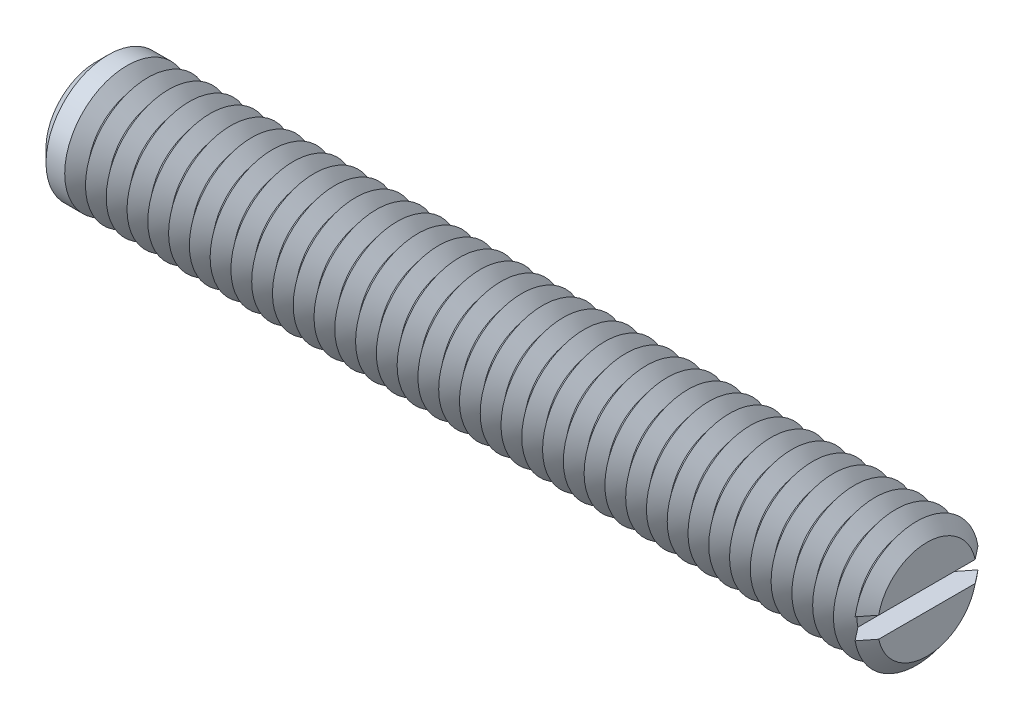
ISO-10303-21;
HEADER;
FILE_DESCRIPTION(('STEP AP214'),'2;1');
FILE_NAME('part.step','',(''),(''),'','','');
FILE_SCHEMA(('AUTOMOTIVE_DESIGN { 1 0 10303 214 1 1 1 1 }'));
ENDSEC;
DATA;
#1=APPLICATION_CONTEXT('core data for automotive mechanical design processes');
#2=APPLICATION_PROTOCOL_DEFINITION('international standard','automotive_design',2000,#1);
#3=PRODUCT_CONTEXT('',#1,'mechanical');
#4=PRODUCT('Part','Part','',(#3));
#5=PRODUCT_RELATED_PRODUCT_CATEGORY('part','',(#4));
#6=PRODUCT_DEFINITION_FORMATION('','',#4);
#7=PRODUCT_DEFINITION_CONTEXT('part definition',#1,'design');
#8=PRODUCT_DEFINITION('design','',#6,#7);
#9=PRODUCT_DEFINITION_SHAPE('','',#8);
#10=(LENGTH_UNIT() NAMED_UNIT(*) SI_UNIT(.MILLI.,.METRE.));
#11=(NAMED_UNIT(*) PLANE_ANGLE_UNIT() SI_UNIT($,.RADIAN.));
#12=(NAMED_UNIT(*) SI_UNIT($,.STERADIAN.) SOLID_ANGLE_UNIT());
#13=UNCERTAINTY_MEASURE_WITH_UNIT(LENGTH_MEASURE(1.E-05),#10,'distance_accuracy_value','');
#14=(GEOMETRIC_REPRESENTATION_CONTEXT(3) GLOBAL_UNCERTAINTY_ASSIGNED_CONTEXT((#13)) GLOBAL_UNIT_ASSIGNED_CONTEXT((#10,
#11,#12)) REPRESENTATION_CONTEXT('',''));
#15=CARTESIAN_POINT('',(0.,0.,0.));
#16=DIRECTION('',(0.,0.,1.));
#17=DIRECTION('',(1.,0.,0.));
#18=AXIS2_PLACEMENT_3D('',#15,#16,#17);
#19=CARTESIAN_POINT('',(19.5,0.,0.));
#20=DIRECTION('',(1.,0.,0.));
#21=DIRECTION('',(0.,0.,-1.));
#22=AXIS2_PLACEMENT_3D('',#19,#20,#21);
#23=CONICAL_SURFACE('',#22,3.,0.895664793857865);
#24=CARTESIAN_POINT('',(19.5,0.,0.));
#25=DIRECTION('',(-1.,0.,0.));
#26=DIRECTION('',(0.,0.,1.));
#27=AXIS2_PLACEMENT_3D('',#24,#25,#26);
#28=CIRCLE('',#27,3.);
#29=CARTESIAN_POINT('',(19.5,-0.5,-2.95803989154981));
#30=VERTEX_POINT('',#29);
#31=CARTESIAN_POINT('',(19.5,-0.5,2.95803989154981));
#32=VERTEX_POINT('',#31);
#33=EDGE_CURVE('E117',#30,#32,#28,.T.);
#34=ORIENTED_EDGE('',*,*,#33,.T.);
#35=CARTESIAN_POINT('',(22.3340158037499,-0.5,-6.52054251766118));
#36=CARTESIAN_POINT('',(22.1513674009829,-0.5,-6.29173953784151));
#37=CARTESIAN_POINT('',(21.9687482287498,-0.5,-6.06291320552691));
#38=CARTESIAN_POINT('',(21.6035782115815,-0.5,-5.60514706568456));
#39=CARTESIAN_POINT('',(21.4210273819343,-0.5,-5.37620724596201));
#40=CARTESIAN_POINT('',(21.0555297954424,-0.5,-4.91755222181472));
#41=CARTESIAN_POINT('',(20.8725834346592,-0.5,-4.68783670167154));
#42=CARTESIAN_POINT('',(20.5069310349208,-0.5,-4.22827290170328));
#43=CARTESIAN_POINT('',(20.3242249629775,-0.5,-3.99842464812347));
#44=CARTESIAN_POINT('',(19.9431833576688,-0.5,-3.51834247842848));
#45=CARTESIAN_POINT('',(19.7448786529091,-0.5,-3.26808406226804));
#46=CARTESIAN_POINT('',(19.4479597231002,-0.5,-2.89216906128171));
#47=CARTESIAN_POINT('',(19.3490516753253,-0.5,-2.76674461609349));
#48=CARTESIAN_POINT('',(19.1515374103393,-0.5,-2.51567085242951));
#49=CARTESIAN_POINT('',(19.0529311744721,-0.5,-2.39002154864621));
#50=CARTESIAN_POINT('',(18.8563868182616,-0.5,-2.13862277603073));
#51=CARTESIAN_POINT('',(18.7584477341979,-0.5,-2.01287406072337));
#52=CARTESIAN_POINT('',(18.5633111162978,-0.5,-1.76075275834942));
#53=CARTESIAN_POINT('',(18.4661137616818,-0.5,-1.63438003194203));
#54=CARTESIAN_POINT('',(18.3214734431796,-0.5,-1.44403413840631));
#55=CARTESIAN_POINT('',(18.2734745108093,-0.5,-1.38048388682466));
#56=CARTESIAN_POINT('',(18.1780284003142,-0.5,-1.25297092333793));
#57=CARTESIAN_POINT('',(18.130581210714,-0.5,-1.18900822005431));
#58=CARTESIAN_POINT('',(18.0365530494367,-0.5,-1.06048551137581));
#59=CARTESIAN_POINT('',(17.9899717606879,-0.5,-0.995925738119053));
#60=CARTESIAN_POINT('',(17.8981961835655,-0.5,-0.865829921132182));
#61=CARTESIAN_POINT('',(17.8530016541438,-0.5,-0.800294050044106));
#62=CARTESIAN_POINT('',(17.7995678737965,-0.5,-0.719528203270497));
#63=CARTESIAN_POINT('',(17.7901114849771,-0.5,-0.705104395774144));
#64=CARTESIAN_POINT('',(17.7713420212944,-0.5,-0.676163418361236));
#65=CARTESIAN_POINT('',(17.762028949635,-0.5,-0.661646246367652));
#66=CARTESIAN_POINT('',(17.7343355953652,-0.5,-0.617935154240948));
#67=CARTESIAN_POINT('',(17.7162024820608,-0.5,-0.588583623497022));
#68=CARTESIAN_POINT('',(17.6808134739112,-0.5,-0.529281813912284));
#69=CARTESIAN_POINT('',(17.6635591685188,-0.5,-0.499330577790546));
#70=CARTESIAN_POINT('',(17.630358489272,-0.5,-0.438714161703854));
#71=CARTESIAN_POINT('',(17.6144119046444,-0.5,-0.408049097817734));
#72=CARTESIAN_POINT('',(17.5785841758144,-0.5,-0.333745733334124));
#73=CARTESIAN_POINT('',(17.5595664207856,-0.5,-0.28967659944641));
#74=CARTESIAN_POINT('',(17.5278600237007,-0.5,-0.199412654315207));
#75=CARTESIAN_POINT('',(17.5151365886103,-0.5,-0.153231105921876));
#76=CARTESIAN_POINT('',(17.501111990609,-0.5,-0.0687562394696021));
#77=CARTESIAN_POINT('',(17.498005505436,-0.5,-0.030783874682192));
#78=CARTESIAN_POINT('',(17.4988722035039,-0.5,0.0450573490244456));
#79=CARTESIAN_POINT('',(17.5028411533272,-0.5,0.0829262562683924));
#80=CARTESIAN_POINT('',(17.5147515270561,-0.5,0.146691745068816));
#81=CARTESIAN_POINT('',(17.5212166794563,-0.5,0.172890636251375));
#82=CARTESIAN_POINT('',(17.5365108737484,-0.5,0.224599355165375));
#83=CARTESIAN_POINT('',(17.5453416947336,-0.5,0.250108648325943));
#84=CARTESIAN_POINT('',(17.5648480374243,-0.5,0.300632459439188));
#85=CARTESIAN_POINT('',(17.5755378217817,-0.5,0.325641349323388));
#86=CARTESIAN_POINT('',(17.598235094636,-0.5,0.375035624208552));
#87=CARTESIAN_POINT('',(17.6102421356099,-0.5,0.399421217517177));
#88=CARTESIAN_POINT('',(17.6509435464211,-0.5,0.478106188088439));
#89=CARTESIAN_POINT('',(17.6816009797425,-0.5,0.531380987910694));
#90=CARTESIAN_POINT('',(17.7454790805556,-0.5,0.636383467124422));
#91=CARTESIAN_POINT('',(17.7787021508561,-0.5,0.688109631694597));
#92=CARTESIAN_POINT('',(17.8467342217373,-0.5,0.790686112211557));
#93=CARTESIAN_POINT('',(17.8815468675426,-0.5,0.841534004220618));
#94=CARTESIAN_POINT('',(17.9520982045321,-0.5,0.942545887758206));
#95=CARTESIAN_POINT('',(17.9878365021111,-0.5,0.992710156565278));
#96=CARTESIAN_POINT('',(18.0600131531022,-0.5,1.09268759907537));
#97=CARTESIAN_POINT('',(18.096452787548,-0.5,1.14249984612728));
#98=CARTESIAN_POINT('',(18.1697745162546,-0.5,1.24180476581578));
#99=CARTESIAN_POINT('',(18.2066566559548,-0.5,1.29129740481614));
#100=CARTESIAN_POINT('',(18.3176541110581,-0.5,1.43926830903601));
#101=CARTESIAN_POINT('',(18.3922352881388,-0.5,1.53739673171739));
#102=CARTESIAN_POINT('',(18.547080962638,-0.5,1.73962858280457));
#103=CARTESIAN_POINT('',(18.6273934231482,-0.5,1.84369513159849));
#104=CARTESIAN_POINT('',(18.7885076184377,-0.5,2.05144913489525));
#105=CARTESIAN_POINT('',(18.8693093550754,-0.5,2.1551365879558));
#106=CARTESIAN_POINT('',(19.1121843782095,-0.5,2.46584176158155));
#107=CARTESIAN_POINT('',(19.2747224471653,-0.5,2.67249578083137));
#108=CARTESIAN_POINT('',(19.6005180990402,-0.5,3.08548885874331));
#109=CARTESIAN_POINT('',(19.7637761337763,-0.5,3.29182756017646));
#110=CARTESIAN_POINT('',(20.0906371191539,-0.5,3.70422676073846));
#111=CARTESIAN_POINT('',(20.2542400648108,-0.5,3.9102872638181));
#112=CARTESIAN_POINT('',(20.5774242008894,-0.5,4.31690950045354));
#113=CARTESIAN_POINT('',(20.7369999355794,-0.5,4.51747557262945));
#114=CARTESIAN_POINT('',(21.0562886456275,-0.5,4.91850000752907));
#115=CARTESIAN_POINT('',(21.2160016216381,-0.5,5.11895836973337));
#116=CARTESIAN_POINT('',(21.5353926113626,-0.5,5.51963619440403));
#117=CARTESIAN_POINT('',(21.6950705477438,-0.5,5.71985571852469));
#118=CARTESIAN_POINT('',(22.0144964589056,-0.5,6.12023723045));
#119=CARTESIAN_POINT('',(22.1742444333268,-0.5,6.32039921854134));
#120=CARTESIAN_POINT('',(22.3340158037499,-0.5,6.52054251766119));
#121=B_SPLINE_CURVE_WITH_KNOTS('',3,(#35,#36,#37,#38,#39,#40,#41,#42,#43,#44,#45,#46,#47,#48,
#49,#50,#51,#52,#53,#54,#55,#56,#57,#58,#59,#60,#61,#62,#63,#64,#65,#66,#67,#68,#69,#70,#71,#72,
#73,#74,#75,#76,#77,#78,#79,#80,#81,#82,#83,#84,#85,#86,#87,#88,#89,#90,#91,#92,#93,#94,#95,#96,
#97,#98,#99,#100,#101,#102,#103,#104,#105,#106,#107,#108,#109,#110,#111,#112,#113,#114,#115,
#116,#117,#118,#119,#120),.UNSPECIFIED.,.F.,.F.,(4,2,2,2,2,2,2,2,2,2,2,2,2,2,2,2,2,2,2,2,2,2,2,
2,2,2,2,2,2,2,2,2,2,2,2,2,2,2,2,2,2,2,4),(0.,0.878294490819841,1.75672728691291,
2.63771941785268,3.51857435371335,4.47648054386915,4.95567426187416,5.4348377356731,
5.91300334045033,6.39128103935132,6.63019943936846,6.86911286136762,7.10793700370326,
7.34671939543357,7.39846053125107,7.45020282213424,7.5536944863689,7.65736712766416,
7.76102302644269,7.90476612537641,8.04770552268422,8.1613778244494,8.27498213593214,
8.35581399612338,8.43670681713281,8.51825011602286,8.59976579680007,8.78399479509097,
8.96839847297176,9.15324864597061,9.3380214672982,9.52317177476,9.70834126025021,
10.0780963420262,10.472454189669,10.8668135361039,11.65555692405,12.4448978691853,
13.2342274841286,14.0031360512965,14.7720482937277,15.5403347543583,16.3086173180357),.UNSPECIFIED.);
#122=CARTESIAN_POINT('',(19.,-0.5,2.32228361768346));
#123=VERTEX_POINT('',#122);
#124=EDGE_CURVE('E109',#123,#32,#121,.T.);
#125=ORIENTED_EDGE('',*,*,#124,.F.);
#126=CARTESIAN_POINT('',(19.,0.,0.));
#127=DIRECTION('',(-1.,0.,0.));
#128=DIRECTION('',(0.,0.,1.));
#129=AXIS2_PLACEMENT_3D('',#126,#127,#128);
#130=CIRCLE('',#129,2.37550020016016);
#131=CARTESIAN_POINT('',(19.,-0.5,-2.32228361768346));
#132=VERTEX_POINT('',#131);
#133=EDGE_CURVE('E529',#132,#123,#130,.T.);
#134=ORIENTED_EDGE('',*,*,#133,.F.);
#135=EDGE_CURVE('E58',#30,#132,#121,.T.);
#136=ORIENTED_EDGE('',*,*,#135,.F.);
#137=EDGE_LOOP('',(#34,#125,#134,#136));
#138=FACE_BOUND('',#137,.T.);
#139=ADVANCED_FACE('F37',(#138),#23,.T.);
#140=CARTESIAN_POINT('',(19.5,0.5,2.95803989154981));
#141=VERTEX_POINT('',#140);
#142=CARTESIAN_POINT('',(19.5,0.5,-2.95803989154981));
#143=VERTEX_POINT('',#142);
#144=EDGE_CURVE('E100',#141,#143,#28,.T.);
#145=ORIENTED_EDGE('',*,*,#144,.T.);
#146=CARTESIAN_POINT('',(22.3340158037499,0.5,6.52054251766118));
#147=CARTESIAN_POINT('',(22.1513674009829,0.5,6.29173953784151));
#148=CARTESIAN_POINT('',(21.9687482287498,0.5,6.06291320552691));
#149=CARTESIAN_POINT('',(21.6035782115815,0.5,5.60514706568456));
#150=CARTESIAN_POINT('',(21.4210273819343,0.5,5.37620724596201));
#151=CARTESIAN_POINT('',(21.0555297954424,0.5,4.91755222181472));
#152=CARTESIAN_POINT('',(20.8725834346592,0.5,4.68783670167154));
#153=CARTESIAN_POINT('',(20.5069310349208,0.5,4.22827290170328));
#154=CARTESIAN_POINT('',(20.3242249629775,0.5,3.99842464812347));
#155=CARTESIAN_POINT('',(19.9431833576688,0.5,3.51834247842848));
#156=CARTESIAN_POINT('',(19.7448786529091,0.5,3.26808406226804));
#157=CARTESIAN_POINT('',(19.4479597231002,0.5,2.89216906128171));
#158=CARTESIAN_POINT('',(19.3490516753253,0.5,2.76674461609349));
#159=CARTESIAN_POINT('',(19.1515374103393,0.5,2.51567085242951));
#160=CARTESIAN_POINT('',(19.0529311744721,0.5,2.39002154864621));
#161=CARTESIAN_POINT('',(18.8563868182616,0.5,2.13862277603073));
#162=CARTESIAN_POINT('',(18.7584477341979,0.5,2.01287406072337));
#163=CARTESIAN_POINT('',(18.5633111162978,0.5,1.76075275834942));
#164=CARTESIAN_POINT('',(18.4661137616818,0.5,1.63438003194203));
#165=CARTESIAN_POINT('',(18.3214734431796,0.5,1.44403413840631));
#166=CARTESIAN_POINT('',(18.2734745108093,0.5,1.38048388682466));
#167=CARTESIAN_POINT('',(18.1780284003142,0.5,1.25297092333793));
#168=CARTESIAN_POINT('',(18.130581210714,0.5,1.18900822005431));
#169=CARTESIAN_POINT('',(18.0365530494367,0.5,1.06048551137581));
#170=CARTESIAN_POINT('',(17.9899717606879,0.5,0.995925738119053));
#171=CARTESIAN_POINT('',(17.8981961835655,0.5,0.865829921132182));
#172=CARTESIAN_POINT('',(17.8530016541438,0.5,0.800294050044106));
#173=CARTESIAN_POINT('',(17.7995678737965,0.5,0.719528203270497));
#174=CARTESIAN_POINT('',(17.7901114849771,0.5,0.705104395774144));
#175=CARTESIAN_POINT('',(17.7713420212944,0.5,0.676163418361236));
#176=CARTESIAN_POINT('',(17.762028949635,0.5,0.661646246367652));
#177=CARTESIAN_POINT('',(17.7343355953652,0.5,0.617935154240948));
#178=CARTESIAN_POINT('',(17.7162024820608,0.5,0.588583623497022));
#179=CARTESIAN_POINT('',(17.6808134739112,0.5,0.529281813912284));
#180=CARTESIAN_POINT('',(17.6635591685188,0.5,0.499330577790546));
#181=CARTESIAN_POINT('',(17.630358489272,0.5,0.438714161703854));
#182=CARTESIAN_POINT('',(17.6144119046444,0.5,0.408049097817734));
#183=CARTESIAN_POINT('',(17.5785841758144,0.5,0.333745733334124));
#184=CARTESIAN_POINT('',(17.5595664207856,0.5,0.28967659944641));
#185=CARTESIAN_POINT('',(17.5278600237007,0.5,0.199412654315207));
#186=CARTESIAN_POINT('',(17.5151365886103,0.5,0.153231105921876));
#187=CARTESIAN_POINT('',(17.501111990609,0.5,0.0687562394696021));
#188=CARTESIAN_POINT('',(17.498005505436,0.5,0.030783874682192));
#189=CARTESIAN_POINT('',(17.4988722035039,0.5,-0.0450573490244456));
#190=CARTESIAN_POINT('',(17.5028411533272,0.5,-0.0829262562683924));
#191=CARTESIAN_POINT('',(17.5147515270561,0.5,-0.146691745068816));
#192=CARTESIAN_POINT('',(17.5212166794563,0.5,-0.172890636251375));
#193=CARTESIAN_POINT('',(17.5365108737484,0.5,-0.224599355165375));
#194=CARTESIAN_POINT('',(17.5453416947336,0.5,-0.250108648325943));
#195=CARTESIAN_POINT('',(17.5648480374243,0.5,-0.300632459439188));
#196=CARTESIAN_POINT('',(17.5755378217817,0.5,-0.325641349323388));
#197=CARTESIAN_POINT('',(17.598235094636,0.5,-0.375035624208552));
#198=CARTESIAN_POINT('',(17.6102421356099,0.5,-0.399421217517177));
#199=CARTESIAN_POINT('',(17.6509435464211,0.5,-0.478106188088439));
#200=CARTESIAN_POINT('',(17.6816009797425,0.5,-0.531380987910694));
#201=CARTESIAN_POINT('',(17.7454790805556,0.5,-0.636383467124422));
#202=CARTESIAN_POINT('',(17.7787021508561,0.5,-0.688109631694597));
#203=CARTESIAN_POINT('',(17.8467342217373,0.5,-0.790686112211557));
#204=CARTESIAN_POINT('',(17.8815468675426,0.5,-0.841534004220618));
#205=CARTESIAN_POINT('',(17.9520982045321,0.5,-0.942545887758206));
#206=CARTESIAN_POINT('',(17.9878365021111,0.5,-0.992710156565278));
#207=CARTESIAN_POINT('',(18.0600131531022,0.5,-1.09268759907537));
#208=CARTESIAN_POINT('',(18.096452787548,0.5,-1.14249984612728));
#209=CARTESIAN_POINT('',(18.1697745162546,0.5,-1.24180476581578));
#210=CARTESIAN_POINT('',(18.2066566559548,0.5,-1.29129740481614));
#211=CARTESIAN_POINT('',(18.3176541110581,0.5,-1.43926830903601));
#212=CARTESIAN_POINT('',(18.3922352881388,0.5,-1.53739673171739));
#213=CARTESIAN_POINT('',(18.547080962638,0.5,-1.73962858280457));
#214=CARTESIAN_POINT('',(18.6273934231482,0.5,-1.84369513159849));
#215=CARTESIAN_POINT('',(18.7885076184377,0.5,-2.05144913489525));
#216=CARTESIAN_POINT('',(18.8693093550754,0.5,-2.1551365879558));
#217=CARTESIAN_POINT('',(19.1121843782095,0.5,-2.46584176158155));
#218=CARTESIAN_POINT('',(19.2747224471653,0.5,-2.67249578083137));
#219=CARTESIAN_POINT('',(19.6005180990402,0.5,-3.08548885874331));
#220=CARTESIAN_POINT('',(19.7637761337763,0.5,-3.29182756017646));
#221=CARTESIAN_POINT('',(20.0906371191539,0.5,-3.70422676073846));
#222=CARTESIAN_POINT('',(20.2542400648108,0.5,-3.9102872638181));
#223=CARTESIAN_POINT('',(20.5774242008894,0.5,-4.31690950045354));
#224=CARTESIAN_POINT('',(20.7369999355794,0.5,-4.51747557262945));
#225=CARTESIAN_POINT('',(21.0562886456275,0.5,-4.91850000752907));
#226=CARTESIAN_POINT('',(21.2160016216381,0.5,-5.11895836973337));
#227=CARTESIAN_POINT('',(21.5353926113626,0.5,-5.51963619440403));
#228=CARTESIAN_POINT('',(21.6950705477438,0.5,-5.71985571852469));
#229=CARTESIAN_POINT('',(22.0144964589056,0.5,-6.12023723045));
#230=CARTESIAN_POINT('',(22.1742444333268,0.5,-6.32039921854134));
#231=CARTESIAN_POINT('',(22.3340158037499,0.5,-6.52054251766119));
#232=B_SPLINE_CURVE_WITH_KNOTS('',3,(#146,#147,#148,#149,#150,#151,#152,#153,#154,#155,#156,
#157,#158,#159,#160,#161,#162,#163,#164,#165,#166,#167,#168,#169,#170,#171,#172,#173,#174,#175,
#176,#177,#178,#179,#180,#181,#182,#183,#184,#185,#186,#187,#188,#189,#190,#191,#192,#193,#194,
#195,#196,#197,#198,#199,#200,#201,#202,#203,#204,#205,#206,#207,#208,#209,#210,#211,#212,#213,
#214,#215,#216,#217,#218,#219,#220,#221,#222,#223,#224,#225,#226,#227,#228,#229,#230,#231),
.UNSPECIFIED.,.F.,.F.,(4,2,2,2,2,2,2,2,2,2,2,2,2,2,2,2,2,2,2,2,2,2,2,2,2,2,2,2,2,2,2,2,2,2,2,2,
2,2,2,2,2,2,4),(0.,0.878294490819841,1.75672728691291,2.63771941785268,3.51857435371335,
4.47648054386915,4.95567426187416,5.4348377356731,5.91300334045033,6.39128103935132,
6.63019943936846,6.86911286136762,7.10793700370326,7.34671939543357,7.39846053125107,
7.45020282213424,7.5536944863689,7.65736712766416,7.76102302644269,7.90476612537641,
8.04770552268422,8.1613778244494,8.27498213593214,8.35581399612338,8.43670681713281,
8.51825011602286,8.59976579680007,8.78399479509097,8.96839847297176,9.15324864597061,
9.3380214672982,9.52317177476,9.70834126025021,10.0780963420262,10.472454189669,
10.8668135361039,11.65555692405,12.4448978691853,13.2342274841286,14.0031360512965,
14.7720482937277,15.5403347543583,16.3086173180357),.UNSPECIFIED.);
#233=CARTESIAN_POINT('',(19.,0.5,-2.32228361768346));
#234=VERTEX_POINT('',#233);
#235=EDGE_CURVE('E110',#234,#143,#232,.T.);
#236=ORIENTED_EDGE('',*,*,#235,.F.);
#237=CARTESIAN_POINT('',(19.,0.5,2.32228361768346));
#238=VERTEX_POINT('',#237);
#239=EDGE_CURVE('E103',#238,#234,#130,.T.);
#240=ORIENTED_EDGE('',*,*,#239,.F.);
#241=EDGE_CURVE('E97',#141,#238,#232,.T.);
#242=ORIENTED_EDGE('',*,*,#241,.F.);
#243=EDGE_LOOP('',(#145,#236,#240,#242));
#244=FACE_BOUND('',#243,.T.);
#245=ADVANCED_FACE('F99',(#244),#23,.T.);
#246=CARTESIAN_POINT('',(19.,0.,0.));
#247=DIRECTION('',(-1.,0.,0.));
#248=DIRECTION('',(0.,0.,1.));
#249=AXIS2_PLACEMENT_3D('',#246,#247,#248);
#250=CONICAL_SURFACE('',#249,2.37550020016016,0.895664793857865);
#251=CARTESIAN_POINT('',(18.5,0.,0.));
#252=DIRECTION('',(-1.,0.,0.));
#253=DIRECTION('',(0.,0.,1.));
#254=AXIS2_PLACEMENT_3D('',#251,#252,#253);
#255=CIRCLE('',#254,3.);
#256=CARTESIAN_POINT('',(18.5,0.,3.));
#257=VERTEX_POINT('',#256);
#258=EDGE_CURVE('E513',#257,#257,#255,.T.);
#259=ORIENTED_EDGE('',*,*,#258,.F.);
#260=EDGE_LOOP('',(#259));
#261=FACE_BOUND('',#260,.T.);
#262=ORIENTED_EDGE('',*,*,#239,.T.);
#263=EDGE_CURVE('E522',#234,#132,#130,.T.);
#264=ORIENTED_EDGE('',*,*,#263,.T.);
#265=ORIENTED_EDGE('',*,*,#133,.T.);
#266=EDGE_CURVE('E520',#123,#238,#130,.T.);
#267=ORIENTED_EDGE('',*,*,#266,.T.);
#268=EDGE_LOOP('',(#262,#264,#265,#267));
#269=FACE_BOUND('',#268,.T.);
#270=ADVANCED_FACE('F168',(#261,#269),#250,.T.);
#271=CARTESIAN_POINT('',(20.,0.,0.));
#272=DIRECTION('',(1.,0.,0.));
#273=DIRECTION('',(0.,0.,-1.));
#274=AXIS2_PLACEMENT_3D('',#271,#272,#273);
#275=PLANE('',#274);
#276=CARTESIAN_POINT('',(20.,0.,0.));
#277=DIRECTION('',(-1.,0.,0.));
#278=DIRECTION('',(0.,0.,1.));
#279=AXIS2_PLACEMENT_3D('',#276,#277,#278);
#280=CIRCLE('',#279,2.37550020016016);
#281=CARTESIAN_POINT('',(20.,0.5,2.32228361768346));
#282=VERTEX_POINT('',#281);
#283=CARTESIAN_POINT('',(20.,0.5,-2.32228361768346));
#284=VERTEX_POINT('',#283);
#285=EDGE_CURVE('E160',#282,#284,#280,.T.);
#286=ORIENTED_EDGE('',*,*,#285,.F.);
#287=DIRECTION('',(0.,0.,1.));
#288=VECTOR('',#287,1.);
#289=CARTESIAN_POINT('',(20.,0.5,0.));
#290=LINE('',#289,#288);
#291=EDGE_CURVE('E122',#284,#282,#290,.T.);
#292=ORIENTED_EDGE('',*,*,#291,.F.);
#293=EDGE_LOOP('',(#286,#292));
#294=FACE_BOUND('',#293,.T.);
#295=ADVANCED_FACE('F172',(#294),#275,.T.);
#296=CARTESIAN_POINT('',(20.,-0.5,-2.32228361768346));
#297=VERTEX_POINT('',#296);
#298=CARTESIAN_POINT('',(20.,-0.5,2.32228361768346));
#299=VERTEX_POINT('',#298);
#300=EDGE_CURVE('E66',#297,#299,#280,.T.);
#301=ORIENTED_EDGE('',*,*,#300,.F.);
#302=DIRECTION('',(0.,0.,-1.));
#303=VECTOR('',#302,1.);
#304=CARTESIAN_POINT('',(20.,-0.5,0.));
#305=LINE('',#304,#303);
#306=EDGE_CURVE('E136',#299,#297,#305,.T.);
#307=ORIENTED_EDGE('',*,*,#306,.F.);
#308=EDGE_LOOP('',(#301,#307));
#309=FACE_BOUND('',#308,.T.);
#310=ADVANCED_FACE('F203',(#309),#275,.T.);
#311=CARTESIAN_POINT('',(20.,0.,0.));
#312=DIRECTION('',(-1.,0.,0.));
#313=DIRECTION('',(0.,0.,1.));
#314=AXIS2_PLACEMENT_3D('',#311,#312,#313);
#315=CONICAL_SURFACE('',#314,2.37550020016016,0.895664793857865);
#316=ORIENTED_EDGE('',*,*,#144,.F.);
#317=CARTESIAN_POINT('',(16.6659841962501,0.5,-6.52054251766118));
#318=CARTESIAN_POINT('',(16.8486325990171,0.5,-6.29173953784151));
#319=CARTESIAN_POINT('',(17.0312517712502,0.5,-6.06291320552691));
#320=CARTESIAN_POINT('',(17.3964217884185,0.5,-5.60514706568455));
#321=CARTESIAN_POINT('',(17.5789726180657,0.5,-5.376207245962));
#322=CARTESIAN_POINT('',(17.9444702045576,0.5,-4.91755222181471));
#323=CARTESIAN_POINT('',(18.1274165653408,0.5,-4.68783670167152));
#324=CARTESIAN_POINT('',(18.4930689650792,0.5,-4.22827290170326));
#325=CARTESIAN_POINT('',(18.6757750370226,0.5,-3.99842464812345));
#326=CARTESIAN_POINT('',(19.0568166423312,0.5,-3.51834247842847));
#327=CARTESIAN_POINT('',(19.2551213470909,0.5,-3.26808406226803));
#328=CARTESIAN_POINT('',(19.5520402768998,0.5,-2.8921690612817));
#329=CARTESIAN_POINT('',(19.6509483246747,0.5,-2.76674461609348));
#330=CARTESIAN_POINT('',(19.8484625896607,0.5,-2.5156708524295));
#331=CARTESIAN_POINT('',(19.9470688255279,0.5,-2.3900215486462));
#332=CARTESIAN_POINT('',(20.1436131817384,0.5,-2.13862277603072));
#333=CARTESIAN_POINT('',(20.2415522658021,0.5,-2.01287406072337));
#334=CARTESIAN_POINT('',(20.4366888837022,0.5,-1.76075275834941));
#335=CARTESIAN_POINT('',(20.5338862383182,0.5,-1.63438003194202));
#336=CARTESIAN_POINT('',(20.6785265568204,0.5,-1.4440341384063));
#337=CARTESIAN_POINT('',(20.7265254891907,0.5,-1.38048388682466));
#338=CARTESIAN_POINT('',(20.8219715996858,0.5,-1.25297092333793));
#339=CARTESIAN_POINT('',(20.869418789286,0.5,-1.18900822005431));
#340=CARTESIAN_POINT('',(20.9634469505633,0.5,-1.06048551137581));
#341=CARTESIAN_POINT('',(21.0100282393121,0.5,-0.995925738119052));
#342=CARTESIAN_POINT('',(21.1018038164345,0.5,-0.865829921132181));
#343=CARTESIAN_POINT('',(21.1469983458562,0.5,-0.800294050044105));
#344=CARTESIAN_POINT('',(21.2004321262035,0.5,-0.719528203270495));
#345=CARTESIAN_POINT('',(21.2098885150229,0.5,-0.705104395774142));
#346=CARTESIAN_POINT('',(21.2286579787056,0.5,-0.676163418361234));
#347=CARTESIAN_POINT('',(21.237971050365,0.5,-0.66164624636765));
#348=CARTESIAN_POINT('',(21.2656644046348,0.5,-0.617935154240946));
#349=CARTESIAN_POINT('',(21.2837975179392,0.5,-0.58858362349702));
#350=CARTESIAN_POINT('',(21.3191865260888,0.5,-0.52928181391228));
#351=CARTESIAN_POINT('',(21.3364408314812,0.5,-0.499330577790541));
#352=CARTESIAN_POINT('',(21.369641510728,0.5,-0.438714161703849));
#353=CARTESIAN_POINT('',(21.3855880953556,0.5,-0.408049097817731));
#354=CARTESIAN_POINT('',(21.4214158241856,0.5,-0.333745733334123));
#355=CARTESIAN_POINT('',(21.4404335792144,0.5,-0.289676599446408));
#356=CARTESIAN_POINT('',(21.4721399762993,0.5,-0.199412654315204));
#357=CARTESIAN_POINT('',(21.4848634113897,0.5,-0.153231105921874));
#358=CARTESIAN_POINT('',(21.498888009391,0.5,-0.0687562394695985));
#359=CARTESIAN_POINT('',(21.501994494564,0.5,-0.0307838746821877));
#360=CARTESIAN_POINT('',(21.5011277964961,0.5,0.0450573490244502));
#361=CARTESIAN_POINT('',(21.4971588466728,0.5,0.0829262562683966));
#362=CARTESIAN_POINT('',(21.4852484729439,0.5,0.146691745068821));
#363=CARTESIAN_POINT('',(21.4787833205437,0.5,0.17289063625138));
#364=CARTESIAN_POINT('',(21.4634891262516,0.5,0.224599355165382));
#365=CARTESIAN_POINT('',(21.4546583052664,0.5,0.250108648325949));
#366=CARTESIAN_POINT('',(21.4351519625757,0.5,0.300632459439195));
#367=CARTESIAN_POINT('',(21.4244621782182,0.5,0.325641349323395));
#368=CARTESIAN_POINT('',(21.401764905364,0.5,0.37503562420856));
#369=CARTESIAN_POINT('',(21.3897578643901,0.5,0.399421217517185));
#370=CARTESIAN_POINT('',(21.3490564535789,0.5,0.478106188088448));
#371=CARTESIAN_POINT('',(21.3183990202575,0.5,0.531380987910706));
#372=CARTESIAN_POINT('',(21.2545209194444,0.5,0.636383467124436));
#373=CARTESIAN_POINT('',(21.2212978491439,0.5,0.688109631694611));
#374=CARTESIAN_POINT('',(21.1532657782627,0.5,0.790686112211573));
#375=CARTESIAN_POINT('',(21.1184531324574,0.5,0.841534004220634));
#376=CARTESIAN_POINT('',(21.0479017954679,0.5,0.942545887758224));
#377=CARTESIAN_POINT('',(21.0121634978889,0.5,0.992710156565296));
#378=CARTESIAN_POINT('',(20.9399868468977,0.5,1.09268759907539));
#379=CARTESIAN_POINT('',(20.9035472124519,0.5,1.1424998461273));
#380=CARTESIAN_POINT('',(20.8302254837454,0.5,1.2418047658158));
#381=CARTESIAN_POINT('',(20.7933433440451,0.5,1.29129740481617));
#382=CARTESIAN_POINT('',(20.6823458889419,0.5,1.43926830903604));
#383=CARTESIAN_POINT('',(20.6077647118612,0.5,1.53739673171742));
#384=CARTESIAN_POINT('',(20.452919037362,0.5,1.7396285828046));
#385=CARTESIAN_POINT('',(20.3726065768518,0.5,1.84369513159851));
#386=CARTESIAN_POINT('',(20.2114923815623,0.5,2.05144913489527));
#387=CARTESIAN_POINT('',(20.1306906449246,0.5,2.15513658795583));
#388=CARTESIAN_POINT('',(19.8878156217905,0.5,2.46584176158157));
#389=CARTESIAN_POINT('',(19.7252775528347,0.5,2.67249578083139));
#390=CARTESIAN_POINT('',(19.3994819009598,0.5,3.08548885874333));
#391=CARTESIAN_POINT('',(19.2362238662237,0.5,3.29182756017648));
#392=CARTESIAN_POINT('',(18.9093628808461,0.5,3.70422676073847));
#393=CARTESIAN_POINT('',(18.7457599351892,0.5,3.91028726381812));
#394=CARTESIAN_POINT('',(18.4225757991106,0.5,4.31690950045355));
#395=CARTESIAN_POINT('',(18.2630000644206,0.5,4.51747557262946));
#396=CARTESIAN_POINT('',(17.9437113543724,0.5,4.91850000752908));
#397=CARTESIAN_POINT('',(17.7839983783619,0.5,5.11895836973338));
#398=CARTESIAN_POINT('',(17.4646073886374,0.5,5.51963619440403));
#399=CARTESIAN_POINT('',(17.3049294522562,0.5,5.71985571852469));
#400=CARTESIAN_POINT('',(16.9855035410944,0.5,6.12023723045));
#401=CARTESIAN_POINT('',(16.8257555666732,0.5,6.32039921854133));
#402=CARTESIAN_POINT('',(16.6659841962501,0.5,6.52054251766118));
#403=B_SPLINE_CURVE_WITH_KNOTS('',3,(#317,#318,#319,#320,#321,#322,#323,#324,#325,#326,#327,
#328,#329,#330,#331,#332,#333,#334,#335,#336,#337,#338,#339,#340,#341,#342,#343,#344,#345,#346,
#347,#348,#349,#350,#351,#352,#353,#354,#355,#356,#357,#358,#359,#360,#361,#362,#363,#364,#365,
#366,#367,#368,#369,#370,#371,#372,#373,#374,#375,#376,#377,#378,#379,#380,#381,#382,#383,#384,
#385,#386,#387,#388,#389,#390,#391,#392,#393,#394,#395,#396,#397,#398,#399,#400,#401,#402),
.UNSPECIFIED.,.F.,.F.,(4,2,2,2,2,2,2,2,2,2,2,2,2,2,2,2,2,2,2,2,2,2,2,2,2,2,2,2,2,2,2,2,2,2,2,2,
2,2,2,2,2,2,4),(0.,0.878294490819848,1.75672728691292,2.6377194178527,3.51857435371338,
4.47648054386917,4.95567426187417,5.43483773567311,5.91300334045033,6.39128103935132,
6.63019943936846,6.86911286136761,7.10793700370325,7.34671939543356,7.39846053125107,
7.45020282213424,7.5536944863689,7.65736712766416,7.76102302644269,7.9047661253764,
8.04770552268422,8.16137782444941,8.27498213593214,8.35581399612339,8.43670681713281,
8.51825011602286,8.59976579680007,8.78399479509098,8.96839847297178,9.15324864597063,
9.33802146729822,9.52317177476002,9.70834126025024,10.0780963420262,10.472454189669,
10.8668135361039,11.65555692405,12.4448978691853,13.2342274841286,14.0031360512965,
14.7720482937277,15.5403347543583,16.3086173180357),.UNSPECIFIED.);
#404=EDGE_CURVE('E41',#282,#141,#403,.T.);
#405=ORIENTED_EDGE('',*,*,#404,.F.);
#406=ORIENTED_EDGE('',*,*,#285,.T.);
#407=EDGE_CURVE('E11',#143,#284,#403,.T.);
#408=ORIENTED_EDGE('',*,*,#407,.F.);
#409=EDGE_LOOP('',(#316,#405,#406,#408));
#410=FACE_BOUND('',#409,.T.);
#411=ADVANCED_FACE('F114',(#410),#315,.T.);
#412=CARTESIAN_POINT('',(20.,0.5,-4.5));
#413=DIRECTION('',(0.,1.,0.));
#414=DIRECTION('',(0.,0.,1.));
#415=AXIS2_PLACEMENT_3D('',#412,#413,#414);
#416=PLANE('',#415);
#417=ORIENTED_EDGE('',*,*,#404,.T.);
#418=ORIENTED_EDGE('',*,*,#241,.T.);
#419=DIRECTION('',(0.,0.,1.));
#420=VECTOR('',#419,1.);
#421=CARTESIAN_POINT('',(19.,0.5,-4.5));
#422=LINE('',#421,#420);
#423=EDGE_CURVE('E145',#234,#238,#422,.T.);
#424=ORIENTED_EDGE('',*,*,#423,.F.);
#425=ORIENTED_EDGE('',*,*,#235,.T.);
#426=ORIENTED_EDGE('',*,*,#407,.T.);
#427=ORIENTED_EDGE('',*,*,#291,.T.);
#428=EDGE_LOOP('',(#417,#418,#424,#425,#426,#427));
#429=FACE_BOUND('',#428,.T.);
#430=ADVANCED_FACE('F120',(#429),#416,.F.);
#431=ORIENTED_EDGE('',*,*,#33,.F.);
#432=CARTESIAN_POINT('',(16.6659841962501,-0.5,6.52054251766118));
#433=CARTESIAN_POINT('',(16.8486325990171,-0.5,6.29173953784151));
#434=CARTESIAN_POINT('',(17.0312517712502,-0.5,6.06291320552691));
#435=CARTESIAN_POINT('',(17.3964217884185,-0.5,5.60514706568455));
#436=CARTESIAN_POINT('',(17.5789726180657,-0.5,5.376207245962));
#437=CARTESIAN_POINT('',(17.9444702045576,-0.5,4.91755222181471));
#438=CARTESIAN_POINT('',(18.1274165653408,-0.5,4.68783670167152));
#439=CARTESIAN_POINT('',(18.4930689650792,-0.5,4.22827290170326));
#440=CARTESIAN_POINT('',(18.6757750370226,-0.5,3.99842464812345));
#441=CARTESIAN_POINT('',(19.0568166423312,-0.5,3.51834247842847));
#442=CARTESIAN_POINT('',(19.2551213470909,-0.5,3.26808406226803));
#443=CARTESIAN_POINT('',(19.5520402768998,-0.5,2.8921690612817));
#444=CARTESIAN_POINT('',(19.6509483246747,-0.5,2.76674461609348));
#445=CARTESIAN_POINT('',(19.8484625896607,-0.5,2.5156708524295));
#446=CARTESIAN_POINT('',(19.9470688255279,-0.5,2.3900215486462));
#447=CARTESIAN_POINT('',(20.1436131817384,-0.5,2.13862277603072));
#448=CARTESIAN_POINT('',(20.2415522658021,-0.5,2.01287406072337));
#449=CARTESIAN_POINT('',(20.4366888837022,-0.5,1.76075275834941));
#450=CARTESIAN_POINT('',(20.5338862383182,-0.5,1.63438003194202));
#451=CARTESIAN_POINT('',(20.6785265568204,-0.5,1.4440341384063));
#452=CARTESIAN_POINT('',(20.7265254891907,-0.5,1.38048388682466));
#453=CARTESIAN_POINT('',(20.8219715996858,-0.5,1.25297092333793));
#454=CARTESIAN_POINT('',(20.869418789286,-0.5,1.18900822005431));
#455=CARTESIAN_POINT('',(20.9634469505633,-0.5,1.06048551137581));
#456=CARTESIAN_POINT('',(21.0100282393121,-0.5,0.995925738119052));
#457=CARTESIAN_POINT('',(21.1018038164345,-0.5,0.865829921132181));
#458=CARTESIAN_POINT('',(21.1469983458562,-0.5,0.800294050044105));
#459=CARTESIAN_POINT('',(21.2004321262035,-0.5,0.719528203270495));
#460=CARTESIAN_POINT('',(21.2098885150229,-0.5,0.705104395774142));
#461=CARTESIAN_POINT('',(21.2286579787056,-0.5,0.676163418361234));
#462=CARTESIAN_POINT('',(21.237971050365,-0.5,0.66164624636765));
#463=CARTESIAN_POINT('',(21.2656644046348,-0.5,0.617935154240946));
#464=CARTESIAN_POINT('',(21.2837975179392,-0.5,0.58858362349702));
#465=CARTESIAN_POINT('',(21.3191865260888,-0.5,0.52928181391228));
#466=CARTESIAN_POINT('',(21.3364408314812,-0.5,0.499330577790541));
#467=CARTESIAN_POINT('',(21.369641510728,-0.5,0.438714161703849));
#468=CARTESIAN_POINT('',(21.3855880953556,-0.5,0.408049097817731));
#469=CARTESIAN_POINT('',(21.4214158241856,-0.5,0.333745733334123));
#470=CARTESIAN_POINT('',(21.4404335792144,-0.5,0.289676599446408));
#471=CARTESIAN_POINT('',(21.4721399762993,-0.5,0.199412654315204));
#472=CARTESIAN_POINT('',(21.4848634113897,-0.5,0.153231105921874));
#473=CARTESIAN_POINT('',(21.498888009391,-0.5,0.0687562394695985));
#474=CARTESIAN_POINT('',(21.501994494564,-0.5,0.0307838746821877));
#475=CARTESIAN_POINT('',(21.5011277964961,-0.5,-0.0450573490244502));
#476=CARTESIAN_POINT('',(21.4971588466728,-0.5,-0.0829262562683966));
#477=CARTESIAN_POINT('',(21.4852484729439,-0.5,-0.146691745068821));
#478=CARTESIAN_POINT('',(21.4787833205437,-0.5,-0.17289063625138));
#479=CARTESIAN_POINT('',(21.4634891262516,-0.5,-0.224599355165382));
#480=CARTESIAN_POINT('',(21.4546583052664,-0.5,-0.250108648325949));
#481=CARTESIAN_POINT('',(21.4351519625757,-0.5,-0.300632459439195));
#482=CARTESIAN_POINT('',(21.4244621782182,-0.5,-0.325641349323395));
#483=CARTESIAN_POINT('',(21.401764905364,-0.5,-0.37503562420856));
#484=CARTESIAN_POINT('',(21.3897578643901,-0.5,-0.399421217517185));
#485=CARTESIAN_POINT('',(21.3490564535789,-0.5,-0.478106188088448));
#486=CARTESIAN_POINT('',(21.3183990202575,-0.5,-0.531380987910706));
#487=CARTESIAN_POINT('',(21.2545209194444,-0.5,-0.636383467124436));
#488=CARTESIAN_POINT('',(21.2212978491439,-0.5,-0.688109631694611));
#489=CARTESIAN_POINT('',(21.1532657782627,-0.5,-0.790686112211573));
#490=CARTESIAN_POINT('',(21.1184531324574,-0.5,-0.841534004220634));
#491=CARTESIAN_POINT('',(21.0479017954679,-0.5,-0.942545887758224));
#492=CARTESIAN_POINT('',(21.0121634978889,-0.5,-0.992710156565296));
#493=CARTESIAN_POINT('',(20.9399868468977,-0.5,-1.09268759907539));
#494=CARTESIAN_POINT('',(20.9035472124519,-0.5,-1.1424998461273));
#495=CARTESIAN_POINT('',(20.8302254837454,-0.5,-1.2418047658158));
#496=CARTESIAN_POINT('',(20.7933433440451,-0.5,-1.29129740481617));
#497=CARTESIAN_POINT('',(20.6823458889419,-0.5,-1.43926830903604));
#498=CARTESIAN_POINT('',(20.6077647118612,-0.5,-1.53739673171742));
#499=CARTESIAN_POINT('',(20.452919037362,-0.5,-1.7396285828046));
#500=CARTESIAN_POINT('',(20.3726065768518,-0.5,-1.84369513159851));
#501=CARTESIAN_POINT('',(20.2114923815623,-0.5,-2.05144913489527));
#502=CARTESIAN_POINT('',(20.1306906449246,-0.5,-2.15513658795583));
#503=CARTESIAN_POINT('',(19.8878156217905,-0.5,-2.46584176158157));
#504=CARTESIAN_POINT('',(19.7252775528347,-0.5,-2.67249578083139));
#505=CARTESIAN_POINT('',(19.3994819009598,-0.5,-3.08548885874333));
#506=CARTESIAN_POINT('',(19.2362238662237,-0.5,-3.29182756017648));
#507=CARTESIAN_POINT('',(18.9093628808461,-0.5,-3.70422676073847));
#508=CARTESIAN_POINT('',(18.7457599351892,-0.5,-3.91028726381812));
#509=CARTESIAN_POINT('',(18.4225757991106,-0.5,-4.31690950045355));
#510=CARTESIAN_POINT('',(18.2630000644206,-0.5,-4.51747557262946));
#511=CARTESIAN_POINT('',(17.9437113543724,-0.5,-4.91850000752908));
#512=CARTESIAN_POINT('',(17.7839983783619,-0.5,-5.11895836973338));
#513=CARTESIAN_POINT('',(17.4646073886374,-0.5,-5.51963619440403));
#514=CARTESIAN_POINT('',(17.3049294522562,-0.5,-5.71985571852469));
#515=CARTESIAN_POINT('',(16.9855035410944,-0.5,-6.12023723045));
#516=CARTESIAN_POINT('',(16.8257555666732,-0.5,-6.32039921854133));
#517=CARTESIAN_POINT('',(16.6659841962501,-0.5,-6.52054251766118));
#518=B_SPLINE_CURVE_WITH_KNOTS('',3,(#432,#433,#434,#435,#436,#437,#438,#439,#440,#441,#442,
#443,#444,#445,#446,#447,#448,#449,#450,#451,#452,#453,#454,#455,#456,#457,#458,#459,#460,#461,
#462,#463,#464,#465,#466,#467,#468,#469,#470,#471,#472,#473,#474,#475,#476,#477,#478,#479,#480,
#481,#482,#483,#484,#485,#486,#487,#488,#489,#490,#491,#492,#493,#494,#495,#496,#497,#498,#499,
#500,#501,#502,#503,#504,#505,#506,#507,#508,#509,#510,#511,#512,#513,#514,#515,#516,#517),
.UNSPECIFIED.,.F.,.F.,(4,2,2,2,2,2,2,2,2,2,2,2,2,2,2,2,2,2,2,2,2,2,2,2,2,2,2,2,2,2,2,2,2,2,2,2,
2,2,2,2,2,2,4),(0.,0.878294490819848,1.75672728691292,2.6377194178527,3.51857435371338,
4.47648054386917,4.95567426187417,5.43483773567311,5.91300334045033,6.39128103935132,
6.63019943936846,6.86911286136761,7.10793700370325,7.34671939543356,7.39846053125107,
7.45020282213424,7.5536944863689,7.65736712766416,7.76102302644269,7.9047661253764,
8.04770552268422,8.16137782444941,8.27498213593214,8.35581399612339,8.43670681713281,
8.51825011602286,8.59976579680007,8.78399479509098,8.96839847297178,9.15324864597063,
9.33802146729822,9.52317177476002,9.70834126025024,10.0780963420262,10.472454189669,
10.8668135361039,11.65555692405,12.4448978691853,13.2342274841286,14.0031360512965,
14.7720482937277,15.5403347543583,16.3086173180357),.UNSPECIFIED.);
#519=EDGE_CURVE('E152',#297,#30,#518,.T.);
#520=ORIENTED_EDGE('',*,*,#519,.F.);
#521=ORIENTED_EDGE('',*,*,#300,.T.);
#522=EDGE_CURVE('E148',#32,#299,#518,.T.);
#523=ORIENTED_EDGE('',*,*,#522,.F.);
#524=EDGE_LOOP('',(#431,#520,#521,#523));
#525=FACE_BOUND('',#524,.T.);
#526=ADVANCED_FACE('F164',(#525),#315,.T.);
#527=CARTESIAN_POINT('',(20.,-0.5,-4.5));
#528=DIRECTION('',(0.,-1.,0.));
#529=DIRECTION('',(0.,0.,-1.));
#530=AXIS2_PLACEMENT_3D('',#527,#528,#529);
#531=PLANE('',#530);
#532=ORIENTED_EDGE('',*,*,#519,.T.);
#533=ORIENTED_EDGE('',*,*,#135,.T.);
#534=DIRECTION('',(0.,0.,1.));
#535=VECTOR('',#534,1.);
#536=CARTESIAN_POINT('',(19.,-0.5,-4.5));
#537=LINE('',#536,#535);
#538=EDGE_CURVE('E144',#132,#123,#537,.T.);
#539=ORIENTED_EDGE('',*,*,#538,.T.);
#540=ORIENTED_EDGE('',*,*,#124,.T.);
#541=ORIENTED_EDGE('',*,*,#522,.T.);
#542=ORIENTED_EDGE('',*,*,#306,.T.);
#543=EDGE_LOOP('',(#532,#533,#539,#540,#541,#542));
#544=FACE_BOUND('',#543,.T.);
#545=ADVANCED_FACE('F161',(#544),#531,.F.);
#546=CARTESIAN_POINT('',(19.,0.5,-4.5));
#547=DIRECTION('',(-1.,0.,0.));
#548=DIRECTION('',(0.,0.,1.));
#549=AXIS2_PLACEMENT_3D('',#546,#547,#548);
#550=PLANE('',#549);
#551=ORIENTED_EDGE('',*,*,#538,.F.);
#552=ORIENTED_EDGE('',*,*,#263,.F.);
#553=ORIENTED_EDGE('',*,*,#423,.T.);
#554=ORIENTED_EDGE('',*,*,#266,.F.);
#555=EDGE_LOOP('',(#551,#552,#553,#554));
#556=FACE_BOUND('',#555,.T.);
#557=ADVANCED_FACE('F533',(#556),#550,.F.);
#558=CARTESIAN_POINT('',(18.,0.,0.));
#559=DIRECTION('',(-1.,0.,0.));
#560=DIRECTION('',(0.,0.,1.));
#561=AXIS2_PLACEMENT_3D('',#558,#559,#560);
#562=CONICAL_SURFACE('',#561,2.37550020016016,0.895664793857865);
#563=CARTESIAN_POINT('',(17.5,0.,0.));
#564=DIRECTION('',(-1.,0.,0.));
#565=DIRECTION('',(0.,0.,1.));
#566=AXIS2_PLACEMENT_3D('',#563,#564,#565);
#567=CIRCLE('',#566,3.);
#568=CARTESIAN_POINT('',(17.5,0.,3.));
#569=VERTEX_POINT('',#568);
#570=EDGE_CURVE('E506',#569,#569,#567,.T.);
#571=ORIENTED_EDGE('',*,*,#570,.F.);
#572=EDGE_LOOP('',(#571));
#573=FACE_BOUND('',#572,.T.);
#574=CARTESIAN_POINT('',(18.,0.,0.));
#575=DIRECTION('',(-1.,0.,0.));
#576=DIRECTION('',(0.,0.,1.));
#577=AXIS2_PLACEMENT_3D('',#574,#575,#576);
#578=CIRCLE('',#577,2.37550020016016);
#579=CARTESIAN_POINT('',(18.,0.,2.37550020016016));
#580=VERTEX_POINT('',#579);
#581=EDGE_CURVE('E517',#580,#580,#578,.T.);
#582=ORIENTED_EDGE('',*,*,#581,.T.);
#583=EDGE_LOOP('',(#582));
#584=FACE_BOUND('',#583,.T.);
#585=ADVANCED_FACE('F177',(#573,#584),#562,.T.);
#586=CARTESIAN_POINT('',(18.5,0.,0.));
#587=DIRECTION('',(1.,0.,0.));
#588=DIRECTION('',(0.,0.,-1.));
#589=AXIS2_PLACEMENT_3D('',#586,#587,#588);
#590=CONICAL_SURFACE('',#589,3.,0.895664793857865);
#591=ORIENTED_EDGE('',*,*,#581,.F.);
#592=EDGE_LOOP('',(#591));
#593=FACE_BOUND('',#592,.T.);
#594=ORIENTED_EDGE('',*,*,#258,.T.);
#595=EDGE_LOOP('',(#594));
#596=FACE_BOUND('',#595,.T.);
#597=ADVANCED_FACE('F539',(#593,#596),#590,.T.);
#598=CARTESIAN_POINT('',(17.,0.,0.));
#599=DIRECTION('',(-1.,0.,0.));
#600=DIRECTION('',(0.,0.,1.));
#601=AXIS2_PLACEMENT_3D('',#598,#599,#600);
#602=CONICAL_SURFACE('',#601,2.37550020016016,0.895664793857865);
#603=CARTESIAN_POINT('',(16.5,0.,0.));
#604=DIRECTION('',(-1.,0.,0.));
#605=DIRECTION('',(0.,0.,1.));
#606=AXIS2_PLACEMENT_3D('',#603,#604,#605);
#607=CIRCLE('',#606,3.);
#608=CARTESIAN_POINT('',(16.5,0.,3.));
#609=VERTEX_POINT('',#608);
#610=EDGE_CURVE('E498',#609,#609,#607,.T.);
#611=ORIENTED_EDGE('',*,*,#610,.F.);
#612=EDGE_LOOP('',(#611));
#613=FACE_BOUND('',#612,.T.);
#614=CARTESIAN_POINT('',(17.,0.,0.));
#615=DIRECTION('',(-1.,0.,0.));
#616=DIRECTION('',(0.,0.,1.));
#617=AXIS2_PLACEMENT_3D('',#614,#615,#616);
#618=CIRCLE('',#617,2.37550020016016);
#619=CARTESIAN_POINT('',(17.,0.,2.37550020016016));
#620=VERTEX_POINT('',#619);
#621=EDGE_CURVE('E510',#620,#620,#618,.T.);
#622=ORIENTED_EDGE('',*,*,#621,.T.);
#623=EDGE_LOOP('',(#622));
#624=FACE_BOUND('',#623,.T.);
#625=ADVANCED_FACE('F603',(#613,#624),#602,.T.);
#626=CARTESIAN_POINT('',(17.5,0.,0.));
#627=DIRECTION('',(1.,0.,0.));
#628=DIRECTION('',(0.,0.,-1.));
#629=AXIS2_PLACEMENT_3D('',#626,#627,#628);
#630=CONICAL_SURFACE('',#629,3.,0.895664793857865);
#631=ORIENTED_EDGE('',*,*,#621,.F.);
#632=EDGE_LOOP('',(#631));
#633=FACE_BOUND('',#632,.T.);
#634=ORIENTED_EDGE('',*,*,#570,.T.);
#635=EDGE_LOOP('',(#634));
#636=FACE_BOUND('',#635,.T.);
#637=ADVANCED_FACE('F612',(#633,#636),#630,.T.);
#638=CARTESIAN_POINT('',(16.,0.,0.));
#639=DIRECTION('',(-1.,0.,0.));
#640=DIRECTION('',(0.,0.,1.));
#641=AXIS2_PLACEMENT_3D('',#638,#639,#640);
#642=CONICAL_SURFACE('',#641,2.37550020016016,0.895664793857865);
#643=CARTESIAN_POINT('',(15.5,0.,0.));
#644=DIRECTION('',(-1.,0.,0.));
#645=DIRECTION('',(0.,0.,1.));
#646=AXIS2_PLACEMENT_3D('',#643,#644,#645);
#647=CIRCLE('',#646,3.);
#648=CARTESIAN_POINT('',(15.5,0.,3.));
#649=VERTEX_POINT('',#648);
#650=EDGE_CURVE('E490',#649,#649,#647,.T.);
#651=ORIENTED_EDGE('',*,*,#650,.F.);
#652=EDGE_LOOP('',(#651));
#653=FACE_BOUND('',#652,.T.);
#654=CARTESIAN_POINT('',(16.,0.,0.));
#655=DIRECTION('',(-1.,0.,0.));
#656=DIRECTION('',(0.,0.,1.));
#657=AXIS2_PLACEMENT_3D('',#654,#655,#656);
#658=CIRCLE('',#657,2.37550020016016);
#659=CARTESIAN_POINT('',(16.,0.,2.37550020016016));
#660=VERTEX_POINT('',#659);
#661=EDGE_CURVE('E502',#660,#660,#658,.T.);
#662=ORIENTED_EDGE('',*,*,#661,.T.);
#663=EDGE_LOOP('',(#662));
#664=FACE_BOUND('',#663,.T.);
#665=ADVANCED_FACE('F622',(#653,#664),#642,.T.);
#666=CARTESIAN_POINT('',(16.5,0.,0.));
#667=DIRECTION('',(1.,0.,0.));
#668=DIRECTION('',(0.,0.,-1.));
#669=AXIS2_PLACEMENT_3D('',#666,#667,#668);
#670=CONICAL_SURFACE('',#669,3.,0.895664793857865);
#671=ORIENTED_EDGE('',*,*,#661,.F.);
#672=EDGE_LOOP('',(#671));
#673=FACE_BOUND('',#672,.T.);
#674=ORIENTED_EDGE('',*,*,#610,.T.);
#675=EDGE_LOOP('',(#674));
#676=FACE_BOUND('',#675,.T.);
#677=ADVANCED_FACE('F632',(#673,#676),#670,.T.);
#678=CARTESIAN_POINT('',(15.,0.,0.));
#679=DIRECTION('',(-1.,0.,0.));
#680=DIRECTION('',(0.,0.,1.));
#681=AXIS2_PLACEMENT_3D('',#678,#679,#680);
#682=CONICAL_SURFACE('',#681,2.37550020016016,0.895664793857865);
#683=CARTESIAN_POINT('',(14.5,0.,0.));
#684=DIRECTION('',(-1.,0.,0.));
#685=DIRECTION('',(0.,0.,1.));
#686=AXIS2_PLACEMENT_3D('',#683,#684,#685);
#687=CIRCLE('',#686,3.);
#688=CARTESIAN_POINT('',(14.5,0.,3.));
#689=VERTEX_POINT('',#688);
#690=EDGE_CURVE('E482',#689,#689,#687,.T.);
#691=ORIENTED_EDGE('',*,*,#690,.F.);
#692=EDGE_LOOP('',(#691));
#693=FACE_BOUND('',#692,.T.);
#694=CARTESIAN_POINT('',(15.,0.,0.));
#695=DIRECTION('',(-1.,0.,0.));
#696=DIRECTION('',(0.,0.,1.));
#697=AXIS2_PLACEMENT_3D('',#694,#695,#696);
#698=CIRCLE('',#697,2.37550020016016);
#699=CARTESIAN_POINT('',(15.,0.,2.37550020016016));
#700=VERTEX_POINT('',#699);
#701=EDGE_CURVE('E494',#700,#700,#698,.T.);
#702=ORIENTED_EDGE('',*,*,#701,.T.);
#703=EDGE_LOOP('',(#702));
#704=FACE_BOUND('',#703,.T.);
#705=ADVANCED_FACE('F642',(#693,#704),#682,.T.);
#706=CARTESIAN_POINT('',(15.5,0.,0.));
#707=DIRECTION('',(1.,0.,0.));
#708=DIRECTION('',(0.,0.,-1.));
#709=AXIS2_PLACEMENT_3D('',#706,#707,#708);
#710=CONICAL_SURFACE('',#709,3.,0.895664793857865);
#711=ORIENTED_EDGE('',*,*,#701,.F.);
#712=EDGE_LOOP('',(#711));
#713=FACE_BOUND('',#712,.T.);
#714=ORIENTED_EDGE('',*,*,#650,.T.);
#715=EDGE_LOOP('',(#714));
#716=FACE_BOUND('',#715,.T.);
#717=ADVANCED_FACE('F652',(#713,#716),#710,.T.);
#718=CARTESIAN_POINT('',(14.,0.,0.));
#719=DIRECTION('',(-1.,0.,0.));
#720=DIRECTION('',(0.,0.,1.));
#721=AXIS2_PLACEMENT_3D('',#718,#719,#720);
#722=CONICAL_SURFACE('',#721,2.37550020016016,0.895664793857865);
#723=CARTESIAN_POINT('',(13.5,0.,0.));
#724=DIRECTION('',(-1.,0.,0.));
#725=DIRECTION('',(0.,0.,1.));
#726=AXIS2_PLACEMENT_3D('',#723,#724,#725);
#727=CIRCLE('',#726,3.);
#728=CARTESIAN_POINT('',(13.5,0.,3.));
#729=VERTEX_POINT('',#728);
#730=EDGE_CURVE('E474',#729,#729,#727,.T.);
#731=ORIENTED_EDGE('',*,*,#730,.F.);
#732=EDGE_LOOP('',(#731));
#733=FACE_BOUND('',#732,.T.);
#734=CARTESIAN_POINT('',(14.,0.,0.));
#735=DIRECTION('',(-1.,0.,0.));
#736=DIRECTION('',(0.,0.,1.));
#737=AXIS2_PLACEMENT_3D('',#734,#735,#736);
#738=CIRCLE('',#737,2.37550020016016);
#739=CARTESIAN_POINT('',(14.,0.,2.37550020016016));
#740=VERTEX_POINT('',#739);
#741=EDGE_CURVE('E486',#740,#740,#738,.T.);
#742=ORIENTED_EDGE('',*,*,#741,.T.);
#743=EDGE_LOOP('',(#742));
#744=FACE_BOUND('',#743,.T.);
#745=ADVANCED_FACE('F662',(#733,#744),#722,.T.);
#746=CARTESIAN_POINT('',(14.5,0.,0.));
#747=DIRECTION('',(1.,0.,0.));
#748=DIRECTION('',(0.,0.,-1.));
#749=AXIS2_PLACEMENT_3D('',#746,#747,#748);
#750=CONICAL_SURFACE('',#749,3.,0.895664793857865);
#751=ORIENTED_EDGE('',*,*,#741,.F.);
#752=EDGE_LOOP('',(#751));
#753=FACE_BOUND('',#752,.T.);
#754=ORIENTED_EDGE('',*,*,#690,.T.);
#755=EDGE_LOOP('',(#754));
#756=FACE_BOUND('',#755,.T.);
#757=ADVANCED_FACE('F672',(#753,#756),#750,.T.);
#758=CARTESIAN_POINT('',(13.,0.,0.));
#759=DIRECTION('',(-1.,0.,0.));
#760=DIRECTION('',(0.,0.,1.));
#761=AXIS2_PLACEMENT_3D('',#758,#759,#760);
#762=CONICAL_SURFACE('',#761,2.37550020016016,0.895664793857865);
#763=CARTESIAN_POINT('',(12.5,0.,0.));
#764=DIRECTION('',(-1.,0.,0.));
#765=DIRECTION('',(0.,0.,1.));
#766=AXIS2_PLACEMENT_3D('',#763,#764,#765);
#767=CIRCLE('',#766,3.);
#768=CARTESIAN_POINT('',(12.5,0.,3.));
#769=VERTEX_POINT('',#768);
#770=EDGE_CURVE('E467',#769,#769,#767,.T.);
#771=ORIENTED_EDGE('',*,*,#770,.F.);
#772=EDGE_LOOP('',(#771));
#773=FACE_BOUND('',#772,.T.);
#774=CARTESIAN_POINT('',(13.,0.,0.));
#775=DIRECTION('',(-1.,0.,0.));
#776=DIRECTION('',(0.,0.,1.));
#777=AXIS2_PLACEMENT_3D('',#774,#775,#776);
#778=CIRCLE('',#777,2.37550020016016);
#779=CARTESIAN_POINT('',(13.,0.,2.37550020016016));
#780=VERTEX_POINT('',#779);
#781=EDGE_CURVE('E478',#780,#780,#778,.T.);
#782=ORIENTED_EDGE('',*,*,#781,.T.);
#783=EDGE_LOOP('',(#782));
#784=FACE_BOUND('',#783,.T.);
#785=ADVANCED_FACE('F682',(#773,#784),#762,.T.);
#786=CARTESIAN_POINT('',(13.5,0.,0.));
#787=DIRECTION('',(1.,0.,0.));
#788=DIRECTION('',(0.,0.,-1.));
#789=AXIS2_PLACEMENT_3D('',#786,#787,#788);
#790=CONICAL_SURFACE('',#789,3.,0.895664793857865);
#791=ORIENTED_EDGE('',*,*,#781,.F.);
#792=EDGE_LOOP('',(#791));
#793=FACE_BOUND('',#792,.T.);
#794=ORIENTED_EDGE('',*,*,#730,.T.);
#795=EDGE_LOOP('',(#794));
#796=FACE_BOUND('',#795,.T.);
#797=ADVANCED_FACE('F692',(#793,#796),#790,.T.);
#798=CARTESIAN_POINT('',(12.,0.,0.));
#799=DIRECTION('',(-1.,0.,0.));
#800=DIRECTION('',(0.,0.,1.));
#801=AXIS2_PLACEMENT_3D('',#798,#799,#800);
#802=CONICAL_SURFACE('',#801,2.37550020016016,0.895664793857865);
#803=CARTESIAN_POINT('',(11.5,0.,0.));
#804=DIRECTION('',(-1.,0.,0.));
#805=DIRECTION('',(0.,0.,1.));
#806=AXIS2_PLACEMENT_3D('',#803,#804,#805);
#807=CIRCLE('',#806,3.);
#808=CARTESIAN_POINT('',(11.5,0.,3.));
#809=VERTEX_POINT('',#808);
#810=EDGE_CURVE('E459',#809,#809,#807,.T.);
#811=ORIENTED_EDGE('',*,*,#810,.F.);
#812=EDGE_LOOP('',(#811));
#813=FACE_BOUND('',#812,.T.);
#814=CARTESIAN_POINT('',(12.,0.,0.));
#815=DIRECTION('',(-1.,0.,0.));
#816=DIRECTION('',(0.,0.,1.));
#817=AXIS2_PLACEMENT_3D('',#814,#815,#816);
#818=CIRCLE('',#817,2.37550020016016);
#819=CARTESIAN_POINT('',(12.,0.,2.37550020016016));
#820=VERTEX_POINT('',#819);
#821=EDGE_CURVE('E471',#820,#820,#818,.T.);
#822=ORIENTED_EDGE('',*,*,#821,.T.);
#823=EDGE_LOOP('',(#822));
#824=FACE_BOUND('',#823,.T.);
#825=ADVANCED_FACE('F702',(#813,#824),#802,.T.);
#826=CARTESIAN_POINT('',(12.5,0.,0.));
#827=DIRECTION('',(1.,0.,0.));
#828=DIRECTION('',(0.,0.,-1.));
#829=AXIS2_PLACEMENT_3D('',#826,#827,#828);
#830=CONICAL_SURFACE('',#829,3.,0.895664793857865);
#831=ORIENTED_EDGE('',*,*,#821,.F.);
#832=EDGE_LOOP('',(#831));
#833=FACE_BOUND('',#832,.T.);
#834=ORIENTED_EDGE('',*,*,#770,.T.);
#835=EDGE_LOOP('',(#834));
#836=FACE_BOUND('',#835,.T.);
#837=ADVANCED_FACE('F712',(#833,#836),#830,.T.);
#838=CARTESIAN_POINT('',(11.,0.,0.));
#839=DIRECTION('',(-1.,0.,0.));
#840=DIRECTION('',(0.,0.,1.));
#841=AXIS2_PLACEMENT_3D('',#838,#839,#840);
#842=CONICAL_SURFACE('',#841,2.37550020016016,0.895664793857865);
#843=CARTESIAN_POINT('',(10.5,0.,0.));
#844=DIRECTION('',(-1.,0.,0.));
#845=DIRECTION('',(0.,0.,1.));
#846=AXIS2_PLACEMENT_3D('',#843,#844,#845);
#847=CIRCLE('',#846,3.);
#848=CARTESIAN_POINT('',(10.5,0.,3.));
#849=VERTEX_POINT('',#848);
#850=EDGE_CURVE('E452',#849,#849,#847,.T.);
#851=ORIENTED_EDGE('',*,*,#850,.F.);
#852=EDGE_LOOP('',(#851));
#853=FACE_BOUND('',#852,.T.);
#854=CARTESIAN_POINT('',(11.,0.,0.));
#855=DIRECTION('',(-1.,0.,0.));
#856=DIRECTION('',(0.,0.,1.));
#857=AXIS2_PLACEMENT_3D('',#854,#855,#856);
#858=CIRCLE('',#857,2.37550020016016);
#859=CARTESIAN_POINT('',(11.,0.,2.37550020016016));
#860=VERTEX_POINT('',#859);
#861=EDGE_CURVE('E463',#860,#860,#858,.T.);
#862=ORIENTED_EDGE('',*,*,#861,.T.);
#863=EDGE_LOOP('',(#862));
#864=FACE_BOUND('',#863,.T.);
#865=ADVANCED_FACE('F722',(#853,#864),#842,.T.);
#866=CARTESIAN_POINT('',(11.5,0.,0.));
#867=DIRECTION('',(1.,0.,0.));
#868=DIRECTION('',(0.,0.,-1.));
#869=AXIS2_PLACEMENT_3D('',#866,#867,#868);
#870=CONICAL_SURFACE('',#869,3.,0.895664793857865);
#871=ORIENTED_EDGE('',*,*,#861,.F.);
#872=EDGE_LOOP('',(#871));
#873=FACE_BOUND('',#872,.T.);
#874=ORIENTED_EDGE('',*,*,#810,.T.);
#875=EDGE_LOOP('',(#874));
#876=FACE_BOUND('',#875,.T.);
#877=ADVANCED_FACE('F732',(#873,#876),#870,.T.);
#878=CARTESIAN_POINT('',(10.,0.,0.));
#879=DIRECTION('',(-1.,0.,0.));
#880=DIRECTION('',(0.,0.,1.));
#881=AXIS2_PLACEMENT_3D('',#878,#879,#880);
#882=CONICAL_SURFACE('',#881,2.37550020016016,0.895664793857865);
#883=CARTESIAN_POINT('',(9.5,0.,0.));
#884=DIRECTION('',(-1.,0.,0.));
#885=DIRECTION('',(0.,0.,1.));
#886=AXIS2_PLACEMENT_3D('',#883,#884,#885);
#887=CIRCLE('',#886,3.);
#888=CARTESIAN_POINT('',(9.5,0.,3.));
#889=VERTEX_POINT('',#888);
#890=EDGE_CURVE('E444',#889,#889,#887,.T.);
#891=ORIENTED_EDGE('',*,*,#890,.F.);
#892=EDGE_LOOP('',(#891));
#893=FACE_BOUND('',#892,.T.);
#894=CARTESIAN_POINT('',(10.,0.,0.));
#895=DIRECTION('',(-1.,0.,0.));
#896=DIRECTION('',(0.,0.,1.));
#897=AXIS2_PLACEMENT_3D('',#894,#895,#896);
#898=CIRCLE('',#897,2.37550020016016);
#899=CARTESIAN_POINT('',(10.,0.,2.37550020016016));
#900=VERTEX_POINT('',#899);
#901=EDGE_CURVE('E456',#900,#900,#898,.T.);
#902=ORIENTED_EDGE('',*,*,#901,.T.);
#903=EDGE_LOOP('',(#902));
#904=FACE_BOUND('',#903,.T.);
#905=ADVANCED_FACE('F742',(#893,#904),#882,.T.);
#906=CARTESIAN_POINT('',(10.5,0.,0.));
#907=DIRECTION('',(1.,0.,0.));
#908=DIRECTION('',(0.,0.,-1.));
#909=AXIS2_PLACEMENT_3D('',#906,#907,#908);
#910=CONICAL_SURFACE('',#909,3.,0.895664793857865);
#911=ORIENTED_EDGE('',*,*,#901,.F.);
#912=EDGE_LOOP('',(#911));
#913=FACE_BOUND('',#912,.T.);
#914=ORIENTED_EDGE('',*,*,#850,.T.);
#915=EDGE_LOOP('',(#914));
#916=FACE_BOUND('',#915,.T.);
#917=ADVANCED_FACE('F752',(#913,#916),#910,.T.);
#918=CARTESIAN_POINT('',(9.,0.,0.));
#919=DIRECTION('',(-1.,0.,0.));
#920=DIRECTION('',(0.,0.,1.));
#921=AXIS2_PLACEMENT_3D('',#918,#919,#920);
#922=CONICAL_SURFACE('',#921,2.37550020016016,0.895664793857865);
#923=CARTESIAN_POINT('',(8.5,0.,0.));
#924=DIRECTION('',(-1.,0.,0.));
#925=DIRECTION('',(0.,0.,1.));
#926=AXIS2_PLACEMENT_3D('',#923,#924,#925);
#927=CIRCLE('',#926,3.);
#928=CARTESIAN_POINT('',(8.5,0.,3.));
#929=VERTEX_POINT('',#928);
#930=EDGE_CURVE('E436',#929,#929,#927,.T.);
#931=ORIENTED_EDGE('',*,*,#930,.F.);
#932=EDGE_LOOP('',(#931));
#933=FACE_BOUND('',#932,.T.);
#934=CARTESIAN_POINT('',(9.,0.,0.));
#935=DIRECTION('',(-1.,0.,0.));
#936=DIRECTION('',(0.,0.,1.));
#937=AXIS2_PLACEMENT_3D('',#934,#935,#936);
#938=CIRCLE('',#937,2.37550020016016);
#939=CARTESIAN_POINT('',(9.,0.,2.37550020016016));
#940=VERTEX_POINT('',#939);
#941=EDGE_CURVE('E448',#940,#940,#938,.T.);
#942=ORIENTED_EDGE('',*,*,#941,.T.);
#943=EDGE_LOOP('',(#942));
#944=FACE_BOUND('',#943,.T.);
#945=ADVANCED_FACE('F762',(#933,#944),#922,.T.);
#946=CARTESIAN_POINT('',(9.5,0.,0.));
#947=DIRECTION('',(1.,0.,0.));
#948=DIRECTION('',(0.,0.,-1.));
#949=AXIS2_PLACEMENT_3D('',#946,#947,#948);
#950=CONICAL_SURFACE('',#949,3.,0.895664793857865);
#951=ORIENTED_EDGE('',*,*,#941,.F.);
#952=EDGE_LOOP('',(#951));
#953=FACE_BOUND('',#952,.T.);
#954=ORIENTED_EDGE('',*,*,#890,.T.);
#955=EDGE_LOOP('',(#954));
#956=FACE_BOUND('',#955,.T.);
#957=ADVANCED_FACE('F772',(#953,#956),#950,.T.);
#958=CARTESIAN_POINT('',(8.,0.,0.));
#959=DIRECTION('',(-1.,0.,0.));
#960=DIRECTION('',(0.,0.,1.));
#961=AXIS2_PLACEMENT_3D('',#958,#959,#960);
#962=CONICAL_SURFACE('',#961,2.37550020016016,0.895664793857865);
#963=CARTESIAN_POINT('',(7.5,0.,0.));
#964=DIRECTION('',(-1.,0.,0.));
#965=DIRECTION('',(0.,0.,1.));
#966=AXIS2_PLACEMENT_3D('',#963,#964,#965);
#967=CIRCLE('',#966,3.);
#968=CARTESIAN_POINT('',(7.5,0.,3.));
#969=VERTEX_POINT('',#968);
#970=EDGE_CURVE('E428',#969,#969,#967,.T.);
#971=ORIENTED_EDGE('',*,*,#970,.F.);
#972=EDGE_LOOP('',(#971));
#973=FACE_BOUND('',#972,.T.);
#974=CARTESIAN_POINT('',(8.,0.,0.));
#975=DIRECTION('',(-1.,0.,0.));
#976=DIRECTION('',(0.,0.,1.));
#977=AXIS2_PLACEMENT_3D('',#974,#975,#976);
#978=CIRCLE('',#977,2.37550020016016);
#979=CARTESIAN_POINT('',(8.,0.,2.37550020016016));
#980=VERTEX_POINT('',#979);
#981=EDGE_CURVE('E440',#980,#980,#978,.T.);
#982=ORIENTED_EDGE('',*,*,#981,.T.);
#983=EDGE_LOOP('',(#982));
#984=FACE_BOUND('',#983,.T.);
#985=ADVANCED_FACE('F782',(#973,#984),#962,.T.);
#986=CARTESIAN_POINT('',(8.5,0.,0.));
#987=DIRECTION('',(1.,0.,0.));
#988=DIRECTION('',(0.,0.,-1.));
#989=AXIS2_PLACEMENT_3D('',#986,#987,#988);
#990=CONICAL_SURFACE('',#989,3.,0.895664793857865);
#991=ORIENTED_EDGE('',*,*,#981,.F.);
#992=EDGE_LOOP('',(#991));
#993=FACE_BOUND('',#992,.T.);
#994=ORIENTED_EDGE('',*,*,#930,.T.);
#995=EDGE_LOOP('',(#994));
#996=FACE_BOUND('',#995,.T.);
#997=ADVANCED_FACE('F792',(#993,#996),#990,.T.);
#998=CARTESIAN_POINT('',(7.,0.,0.));
#999=DIRECTION('',(-1.,0.,0.));
#1000=DIRECTION('',(0.,0.,1.));
#1001=AXIS2_PLACEMENT_3D('',#998,#999,#1000);
#1002=CONICAL_SURFACE('',#1001,2.37550020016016,0.895664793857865);
#1003=CARTESIAN_POINT('',(6.5,0.,0.));
#1004=DIRECTION('',(-1.,0.,0.));
#1005=DIRECTION('',(0.,0.,1.));
#1006=AXIS2_PLACEMENT_3D('',#1003,#1004,#1005);
#1007=CIRCLE('',#1006,3.);
#1008=CARTESIAN_POINT('',(6.5,0.,3.));
#1009=VERTEX_POINT('',#1008);
#1010=EDGE_CURVE('E420',#1009,#1009,#1007,.T.);
#1011=ORIENTED_EDGE('',*,*,#1010,.F.);
#1012=EDGE_LOOP('',(#1011));
#1013=FACE_BOUND('',#1012,.T.);
#1014=CARTESIAN_POINT('',(7.,0.,0.));
#1015=DIRECTION('',(-1.,0.,0.));
#1016=DIRECTION('',(0.,0.,1.));
#1017=AXIS2_PLACEMENT_3D('',#1014,#1015,#1016);
#1018=CIRCLE('',#1017,2.37550020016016);
#1019=CARTESIAN_POINT('',(7.,0.,2.37550020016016));
#1020=VERTEX_POINT('',#1019);
#1021=EDGE_CURVE('E432',#1020,#1020,#1018,.T.);
#1022=ORIENTED_EDGE('',*,*,#1021,.T.);
#1023=EDGE_LOOP('',(#1022));
#1024=FACE_BOUND('',#1023,.T.);
#1025=ADVANCED_FACE('F802',(#1013,#1024),#1002,.T.);
#1026=CARTESIAN_POINT('',(7.5,0.,0.));
#1027=DIRECTION('',(1.,0.,0.));
#1028=DIRECTION('',(0.,0.,-1.));
#1029=AXIS2_PLACEMENT_3D('',#1026,#1027,#1028);
#1030=CONICAL_SURFACE('',#1029,3.,0.895664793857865);
#1031=ORIENTED_EDGE('',*,*,#1021,.F.);
#1032=EDGE_LOOP('',(#1031));
#1033=FACE_BOUND('',#1032,.T.);
#1034=ORIENTED_EDGE('',*,*,#970,.T.);
#1035=EDGE_LOOP('',(#1034));
#1036=FACE_BOUND('',#1035,.T.);
#1037=ADVANCED_FACE('F812',(#1033,#1036),#1030,.T.);
#1038=CARTESIAN_POINT('',(6.,0.,0.));
#1039=DIRECTION('',(-1.,0.,0.));
#1040=DIRECTION('',(0.,0.,1.));
#1041=AXIS2_PLACEMENT_3D('',#1038,#1039,#1040);
#1042=CONICAL_SURFACE('',#1041,2.37550020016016,0.895664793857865);
#1043=CARTESIAN_POINT('',(5.5,0.,0.));
#1044=DIRECTION('',(-1.,0.,0.));
#1045=DIRECTION('',(0.,0.,1.));
#1046=AXIS2_PLACEMENT_3D('',#1043,#1044,#1045);
#1047=CIRCLE('',#1046,3.);
#1048=CARTESIAN_POINT('',(5.5,0.,3.));
#1049=VERTEX_POINT('',#1048);
#1050=EDGE_CURVE('E412',#1049,#1049,#1047,.T.);
#1051=ORIENTED_EDGE('',*,*,#1050,.F.);
#1052=EDGE_LOOP('',(#1051));
#1053=FACE_BOUND('',#1052,.T.);
#1054=CARTESIAN_POINT('',(6.,0.,0.));
#1055=DIRECTION('',(-1.,0.,0.));
#1056=DIRECTION('',(0.,0.,1.));
#1057=AXIS2_PLACEMENT_3D('',#1054,#1055,#1056);
#1058=CIRCLE('',#1057,2.37550020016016);
#1059=CARTESIAN_POINT('',(6.,0.,2.37550020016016));
#1060=VERTEX_POINT('',#1059);
#1061=EDGE_CURVE('E424',#1060,#1060,#1058,.T.);
#1062=ORIENTED_EDGE('',*,*,#1061,.T.);
#1063=EDGE_LOOP('',(#1062));
#1064=FACE_BOUND('',#1063,.T.);
#1065=ADVANCED_FACE('F822',(#1053,#1064),#1042,.T.);
#1066=CARTESIAN_POINT('',(6.5,0.,0.));
#1067=DIRECTION('',(1.,0.,0.));
#1068=DIRECTION('',(0.,0.,-1.));
#1069=AXIS2_PLACEMENT_3D('',#1066,#1067,#1068);
#1070=CONICAL_SURFACE('',#1069,3.,0.895664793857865);
#1071=ORIENTED_EDGE('',*,*,#1061,.F.);
#1072=EDGE_LOOP('',(#1071));
#1073=FACE_BOUND('',#1072,.T.);
#1074=ORIENTED_EDGE('',*,*,#1010,.T.);
#1075=EDGE_LOOP('',(#1074));
#1076=FACE_BOUND('',#1075,.T.);
#1077=ADVANCED_FACE('F832',(#1073,#1076),#1070,.T.);
#1078=CARTESIAN_POINT('',(5.,0.,0.));
#1079=DIRECTION('',(-1.,0.,0.));
#1080=DIRECTION('',(0.,0.,1.));
#1081=AXIS2_PLACEMENT_3D('',#1078,#1079,#1080);
#1082=CONICAL_SURFACE('',#1081,2.37550020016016,0.895664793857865);
#1083=CARTESIAN_POINT('',(4.5,0.,0.));
#1084=DIRECTION('',(-1.,0.,0.));
#1085=DIRECTION('',(0.,0.,1.));
#1086=AXIS2_PLACEMENT_3D('',#1083,#1084,#1085);
#1087=CIRCLE('',#1086,3.);
#1088=CARTESIAN_POINT('',(4.5,0.,3.));
#1089=VERTEX_POINT('',#1088);
#1090=EDGE_CURVE('E404',#1089,#1089,#1087,.T.);
#1091=ORIENTED_EDGE('',*,*,#1090,.F.);
#1092=EDGE_LOOP('',(#1091));
#1093=FACE_BOUND('',#1092,.T.);
#1094=CARTESIAN_POINT('',(5.,0.,0.));
#1095=DIRECTION('',(-1.,0.,0.));
#1096=DIRECTION('',(0.,0.,1.));
#1097=AXIS2_PLACEMENT_3D('',#1094,#1095,#1096);
#1098=CIRCLE('',#1097,2.37550020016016);
#1099=CARTESIAN_POINT('',(5.,0.,2.37550020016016));
#1100=VERTEX_POINT('',#1099);
#1101=EDGE_CURVE('E416',#1100,#1100,#1098,.T.);
#1102=ORIENTED_EDGE('',*,*,#1101,.T.);
#1103=EDGE_LOOP('',(#1102));
#1104=FACE_BOUND('',#1103,.T.);
#1105=ADVANCED_FACE('F842',(#1093,#1104),#1082,.T.);
#1106=CARTESIAN_POINT('',(5.5,0.,0.));
#1107=DIRECTION('',(1.,0.,0.));
#1108=DIRECTION('',(0.,0.,-1.));
#1109=AXIS2_PLACEMENT_3D('',#1106,#1107,#1108);
#1110=CONICAL_SURFACE('',#1109,3.,0.895664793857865);
#1111=ORIENTED_EDGE('',*,*,#1101,.F.);
#1112=EDGE_LOOP('',(#1111));
#1113=FACE_BOUND('',#1112,.T.);
#1114=ORIENTED_EDGE('',*,*,#1050,.T.);
#1115=EDGE_LOOP('',(#1114));
#1116=FACE_BOUND('',#1115,.T.);
#1117=ADVANCED_FACE('F852',(#1113,#1116),#1110,.T.);
#1118=CARTESIAN_POINT('',(4.,0.,0.));
#1119=DIRECTION('',(-1.,0.,0.));
#1120=DIRECTION('',(0.,0.,1.));
#1121=AXIS2_PLACEMENT_3D('',#1118,#1119,#1120);
#1122=CONICAL_SURFACE('',#1121,2.37550020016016,0.895664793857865);
#1123=CARTESIAN_POINT('',(3.5,0.,0.));
#1124=DIRECTION('',(-1.,0.,0.));
#1125=DIRECTION('',(0.,0.,1.));
#1126=AXIS2_PLACEMENT_3D('',#1123,#1124,#1125);
#1127=CIRCLE('',#1126,3.);
#1128=CARTESIAN_POINT('',(3.5,0.,3.));
#1129=VERTEX_POINT('',#1128);
#1130=EDGE_CURVE('E396',#1129,#1129,#1127,.T.);
#1131=ORIENTED_EDGE('',*,*,#1130,.F.);
#1132=EDGE_LOOP('',(#1131));
#1133=FACE_BOUND('',#1132,.T.);
#1134=CARTESIAN_POINT('',(4.,0.,0.));
#1135=DIRECTION('',(-1.,0.,0.));
#1136=DIRECTION('',(0.,0.,1.));
#1137=AXIS2_PLACEMENT_3D('',#1134,#1135,#1136);
#1138=CIRCLE('',#1137,2.37550020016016);
#1139=CARTESIAN_POINT('',(4.,0.,2.37550020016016));
#1140=VERTEX_POINT('',#1139);
#1141=EDGE_CURVE('E408',#1140,#1140,#1138,.T.);
#1142=ORIENTED_EDGE('',*,*,#1141,.T.);
#1143=EDGE_LOOP('',(#1142));
#1144=FACE_BOUND('',#1143,.T.);
#1145=ADVANCED_FACE('F862',(#1133,#1144),#1122,.T.);
#1146=CARTESIAN_POINT('',(4.5,0.,0.));
#1147=DIRECTION('',(1.,0.,0.));
#1148=DIRECTION('',(0.,0.,-1.));
#1149=AXIS2_PLACEMENT_3D('',#1146,#1147,#1148);
#1150=CONICAL_SURFACE('',#1149,3.,0.895664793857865);
#1151=ORIENTED_EDGE('',*,*,#1141,.F.);
#1152=EDGE_LOOP('',(#1151));
#1153=FACE_BOUND('',#1152,.T.);
#1154=ORIENTED_EDGE('',*,*,#1090,.T.);
#1155=EDGE_LOOP('',(#1154));
#1156=FACE_BOUND('',#1155,.T.);
#1157=ADVANCED_FACE('F872',(#1153,#1156),#1150,.T.);
#1158=CARTESIAN_POINT('',(3.,0.,0.));
#1159=DIRECTION('',(-1.,0.,0.));
#1160=DIRECTION('',(0.,0.,1.));
#1161=AXIS2_PLACEMENT_3D('',#1158,#1159,#1160);
#1162=CONICAL_SURFACE('',#1161,2.37550020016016,0.895664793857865);
#1163=CARTESIAN_POINT('',(2.5,0.,0.));
#1164=DIRECTION('',(-1.,0.,0.));
#1165=DIRECTION('',(0.,0.,1.));
#1166=AXIS2_PLACEMENT_3D('',#1163,#1164,#1165);
#1167=CIRCLE('',#1166,3.);
#1168=CARTESIAN_POINT('',(2.5,0.,3.));
#1169=VERTEX_POINT('',#1168);
#1170=EDGE_CURVE('E388',#1169,#1169,#1167,.T.);
#1171=ORIENTED_EDGE('',*,*,#1170,.F.);
#1172=EDGE_LOOP('',(#1171));
#1173=FACE_BOUND('',#1172,.T.);
#1174=CARTESIAN_POINT('',(3.,0.,0.));
#1175=DIRECTION('',(-1.,0.,0.));
#1176=DIRECTION('',(0.,0.,1.));
#1177=AXIS2_PLACEMENT_3D('',#1174,#1175,#1176);
#1178=CIRCLE('',#1177,2.37550020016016);
#1179=CARTESIAN_POINT('',(3.,0.,2.37550020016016));
#1180=VERTEX_POINT('',#1179);
#1181=EDGE_CURVE('E400',#1180,#1180,#1178,.T.);
#1182=ORIENTED_EDGE('',*,*,#1181,.T.);
#1183=EDGE_LOOP('',(#1182));
#1184=FACE_BOUND('',#1183,.T.);
#1185=ADVANCED_FACE('F882',(#1173,#1184),#1162,.T.);
#1186=CARTESIAN_POINT('',(3.5,0.,0.));
#1187=DIRECTION('',(1.,0.,0.));
#1188=DIRECTION('',(0.,0.,-1.));
#1189=AXIS2_PLACEMENT_3D('',#1186,#1187,#1188);
#1190=CONICAL_SURFACE('',#1189,3.,0.895664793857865);
#1191=ORIENTED_EDGE('',*,*,#1181,.F.);
#1192=EDGE_LOOP('',(#1191));
#1193=FACE_BOUND('',#1192,.T.);
#1194=ORIENTED_EDGE('',*,*,#1130,.T.);
#1195=EDGE_LOOP('',(#1194));
#1196=FACE_BOUND('',#1195,.T.);
#1197=ADVANCED_FACE('F892',(#1193,#1196),#1190,.T.);
#1198=CARTESIAN_POINT('',(2.,0.,0.));
#1199=DIRECTION('',(-1.,0.,0.));
#1200=DIRECTION('',(0.,0.,1.));
#1201=AXIS2_PLACEMENT_3D('',#1198,#1199,#1200);
#1202=CONICAL_SURFACE('',#1201,2.37550020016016,0.895664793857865);
#1203=CARTESIAN_POINT('',(1.5,0.,0.));
#1204=DIRECTION('',(-1.,0.,0.));
#1205=DIRECTION('',(0.,0.,1.));
#1206=AXIS2_PLACEMENT_3D('',#1203,#1204,#1205);
#1207=CIRCLE('',#1206,3.);
#1208=CARTESIAN_POINT('',(1.5,0.,3.));
#1209=VERTEX_POINT('',#1208);
#1210=EDGE_CURVE('E380',#1209,#1209,#1207,.T.);
#1211=ORIENTED_EDGE('',*,*,#1210,.F.);
#1212=EDGE_LOOP('',(#1211));
#1213=FACE_BOUND('',#1212,.T.);
#1214=CARTESIAN_POINT('',(2.,0.,0.));
#1215=DIRECTION('',(-1.,0.,0.));
#1216=DIRECTION('',(0.,0.,1.));
#1217=AXIS2_PLACEMENT_3D('',#1214,#1215,#1216);
#1218=CIRCLE('',#1217,2.37550020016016);
#1219=CARTESIAN_POINT('',(2.,0.,2.37550020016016));
#1220=VERTEX_POINT('',#1219);
#1221=EDGE_CURVE('E392',#1220,#1220,#1218,.T.);
#1222=ORIENTED_EDGE('',*,*,#1221,.T.);
#1223=EDGE_LOOP('',(#1222));
#1224=FACE_BOUND('',#1223,.T.);
#1225=ADVANCED_FACE('F902',(#1213,#1224),#1202,.T.);
#1226=CARTESIAN_POINT('',(2.5,0.,0.));
#1227=DIRECTION('',(1.,0.,0.));
#1228=DIRECTION('',(0.,0.,-1.));
#1229=AXIS2_PLACEMENT_3D('',#1226,#1227,#1228);
#1230=CONICAL_SURFACE('',#1229,3.,0.895664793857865);
#1231=ORIENTED_EDGE('',*,*,#1221,.F.);
#1232=EDGE_LOOP('',(#1231));
#1233=FACE_BOUND('',#1232,.T.);
#1234=ORIENTED_EDGE('',*,*,#1170,.T.);
#1235=EDGE_LOOP('',(#1234));
#1236=FACE_BOUND('',#1235,.T.);
#1237=ADVANCED_FACE('F912',(#1233,#1236),#1230,.T.);
#1238=CARTESIAN_POINT('',(1.,0.,0.));
#1239=DIRECTION('',(-1.,0.,0.));
#1240=DIRECTION('',(0.,0.,1.));
#1241=AXIS2_PLACEMENT_3D('',#1238,#1239,#1240);
#1242=CONICAL_SURFACE('',#1241,2.37550020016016,0.895664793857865);
#1243=CARTESIAN_POINT('',(0.5,0.,0.));
#1244=DIRECTION('',(-1.,0.,0.));
#1245=DIRECTION('',(0.,0.,1.));
#1246=AXIS2_PLACEMENT_3D('',#1243,#1244,#1245);
#1247=CIRCLE('',#1246,3.);
#1248=CARTESIAN_POINT('',(0.5,0.,3.));
#1249=VERTEX_POINT('',#1248);
#1250=EDGE_CURVE('E372',#1249,#1249,#1247,.T.);
#1251=ORIENTED_EDGE('',*,*,#1250,.F.);
#1252=EDGE_LOOP('',(#1251));
#1253=FACE_BOUND('',#1252,.T.);
#1254=CARTESIAN_POINT('',(1.,0.,0.));
#1255=DIRECTION('',(-1.,0.,0.));
#1256=DIRECTION('',(0.,0.,1.));
#1257=AXIS2_PLACEMENT_3D('',#1254,#1255,#1256);
#1258=CIRCLE('',#1257,2.37550020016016);
#1259=CARTESIAN_POINT('',(1.,0.,2.37550020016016));
#1260=VERTEX_POINT('',#1259);
#1261=EDGE_CURVE('E384',#1260,#1260,#1258,.T.);
#1262=ORIENTED_EDGE('',*,*,#1261,.T.);
#1263=EDGE_LOOP('',(#1262));
#1264=FACE_BOUND('',#1263,.T.);
#1265=ADVANCED_FACE('F922',(#1253,#1264),#1242,.T.);
#1266=CARTESIAN_POINT('',(1.5,0.,0.));
#1267=DIRECTION('',(1.,0.,0.));
#1268=DIRECTION('',(0.,0.,-1.));
#1269=AXIS2_PLACEMENT_3D('',#1266,#1267,#1268);
#1270=CONICAL_SURFACE('',#1269,3.,0.895664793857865);
#1271=ORIENTED_EDGE('',*,*,#1261,.F.);
#1272=EDGE_LOOP('',(#1271));
#1273=FACE_BOUND('',#1272,.T.);
#1274=ORIENTED_EDGE('',*,*,#1210,.T.);
#1275=EDGE_LOOP('',(#1274));
#1276=FACE_BOUND('',#1275,.T.);
#1277=ADVANCED_FACE('F932',(#1273,#1276),#1270,.T.);
#1278=CARTESIAN_POINT('',(0.,0.,0.));
#1279=DIRECTION('',(-1.,0.,0.));
#1280=DIRECTION('',(0.,0.,1.));
#1281=AXIS2_PLACEMENT_3D('',#1278,#1279,#1280);
#1282=CONICAL_SURFACE('',#1281,2.37550020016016,0.895664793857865);
#1283=CARTESIAN_POINT('',(-0.5,0.,0.));
#1284=DIRECTION('',(-1.,0.,0.));
#1285=DIRECTION('',(0.,0.,1.));
#1286=AXIS2_PLACEMENT_3D('',#1283,#1284,#1285);
#1287=CIRCLE('',#1286,3.);
#1288=CARTESIAN_POINT('',(-0.5,0.,3.));
#1289=VERTEX_POINT('',#1288);
#1290=EDGE_CURVE('E364',#1289,#1289,#1287,.T.);
#1291=ORIENTED_EDGE('',*,*,#1290,.F.);
#1292=EDGE_LOOP('',(#1291));
#1293=FACE_BOUND('',#1292,.T.);
#1294=CARTESIAN_POINT('',(0.,0.,0.));
#1295=DIRECTION('',(-1.,0.,0.));
#1296=DIRECTION('',(0.,0.,1.));
#1297=AXIS2_PLACEMENT_3D('',#1294,#1295,#1296);
#1298=CIRCLE('',#1297,2.37550020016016);
#1299=CARTESIAN_POINT('',(0.,0.,2.37550020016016));
#1300=VERTEX_POINT('',#1299);
#1301=EDGE_CURVE('E376',#1300,#1300,#1298,.T.);
#1302=ORIENTED_EDGE('',*,*,#1301,.T.);
#1303=EDGE_LOOP('',(#1302));
#1304=FACE_BOUND('',#1303,.T.);
#1305=ADVANCED_FACE('F942',(#1293,#1304),#1282,.T.);
#1306=CARTESIAN_POINT('',(0.5,0.,0.));
#1307=DIRECTION('',(1.,0.,0.));
#1308=DIRECTION('',(0.,0.,-1.));
#1309=AXIS2_PLACEMENT_3D('',#1306,#1307,#1308);
#1310=CONICAL_SURFACE('',#1309,3.,0.895664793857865);
#1311=ORIENTED_EDGE('',*,*,#1301,.F.);
#1312=EDGE_LOOP('',(#1311));
#1313=FACE_BOUND('',#1312,.T.);
#1314=ORIENTED_EDGE('',*,*,#1250,.T.);
#1315=EDGE_LOOP('',(#1314));
#1316=FACE_BOUND('',#1315,.T.);
#1317=ADVANCED_FACE('F952',(#1313,#1316),#1310,.T.);
#1318=CARTESIAN_POINT('',(-1.,0.,0.));
#1319=DIRECTION('',(-1.,0.,0.));
#1320=DIRECTION('',(0.,0.,1.));
#1321=AXIS2_PLACEMENT_3D('',#1318,#1319,#1320);
#1322=CONICAL_SURFACE('',#1321,2.37550020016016,0.895664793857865);
#1323=CARTESIAN_POINT('',(-1.5,0.,0.));
#1324=DIRECTION('',(-1.,0.,0.));
#1325=DIRECTION('',(0.,0.,1.));
#1326=AXIS2_PLACEMENT_3D('',#1323,#1324,#1325);
#1327=CIRCLE('',#1326,3.);
#1328=CARTESIAN_POINT('',(-1.5,0.,3.));
#1329=VERTEX_POINT('',#1328);
#1330=EDGE_CURVE('E356',#1329,#1329,#1327,.T.);
#1331=ORIENTED_EDGE('',*,*,#1330,.F.);
#1332=EDGE_LOOP('',(#1331));
#1333=FACE_BOUND('',#1332,.T.);
#1334=CARTESIAN_POINT('',(-1.,0.,0.));
#1335=DIRECTION('',(-1.,0.,0.));
#1336=DIRECTION('',(0.,0.,1.));
#1337=AXIS2_PLACEMENT_3D('',#1334,#1335,#1336);
#1338=CIRCLE('',#1337,2.37550020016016);
#1339=CARTESIAN_POINT('',(-1.,0.,2.37550020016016));
#1340=VERTEX_POINT('',#1339);
#1341=EDGE_CURVE('E368',#1340,#1340,#1338,.T.);
#1342=ORIENTED_EDGE('',*,*,#1341,.T.);
#1343=EDGE_LOOP('',(#1342));
#1344=FACE_BOUND('',#1343,.T.);
#1345=ADVANCED_FACE('F962',(#1333,#1344),#1322,.T.);
#1346=CARTESIAN_POINT('',(-0.5,0.,0.));
#1347=DIRECTION('',(1.,0.,0.));
#1348=DIRECTION('',(0.,0.,-1.));
#1349=AXIS2_PLACEMENT_3D('',#1346,#1347,#1348);
#1350=CONICAL_SURFACE('',#1349,3.,0.895664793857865);
#1351=ORIENTED_EDGE('',*,*,#1341,.F.);
#1352=EDGE_LOOP('',(#1351));
#1353=FACE_BOUND('',#1352,.T.);
#1354=ORIENTED_EDGE('',*,*,#1290,.T.);
#1355=EDGE_LOOP('',(#1354));
#1356=FACE_BOUND('',#1355,.T.);
#1357=ADVANCED_FACE('F972',(#1353,#1356),#1350,.T.);
#1358=CARTESIAN_POINT('',(-2.,0.,0.));
#1359=DIRECTION('',(-1.,0.,0.));
#1360=DIRECTION('',(0.,0.,1.));
#1361=AXIS2_PLACEMENT_3D('',#1358,#1359,#1360);
#1362=CONICAL_SURFACE('',#1361,2.37550020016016,0.895664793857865);
#1363=CARTESIAN_POINT('',(-2.5,0.,0.));
#1364=DIRECTION('',(-1.,0.,0.));
#1365=DIRECTION('',(0.,0.,1.));
#1366=AXIS2_PLACEMENT_3D('',#1363,#1364,#1365);
#1367=CIRCLE('',#1366,3.);
#1368=CARTESIAN_POINT('',(-2.5,0.,3.));
#1369=VERTEX_POINT('',#1368);
#1370=EDGE_CURVE('E348',#1369,#1369,#1367,.T.);
#1371=ORIENTED_EDGE('',*,*,#1370,.F.);
#1372=EDGE_LOOP('',(#1371));
#1373=FACE_BOUND('',#1372,.T.);
#1374=CARTESIAN_POINT('',(-2.,0.,0.));
#1375=DIRECTION('',(-1.,0.,0.));
#1376=DIRECTION('',(0.,0.,1.));
#1377=AXIS2_PLACEMENT_3D('',#1374,#1375,#1376);
#1378=CIRCLE('',#1377,2.37550020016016);
#1379=CARTESIAN_POINT('',(-2.,0.,2.37550020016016));
#1380=VERTEX_POINT('',#1379);
#1381=EDGE_CURVE('E360',#1380,#1380,#1378,.T.);
#1382=ORIENTED_EDGE('',*,*,#1381,.T.);
#1383=EDGE_LOOP('',(#1382));
#1384=FACE_BOUND('',#1383,.T.);
#1385=ADVANCED_FACE('F982',(#1373,#1384),#1362,.T.);
#1386=CARTESIAN_POINT('',(-1.5,0.,0.));
#1387=DIRECTION('',(1.,0.,0.));
#1388=DIRECTION('',(0.,0.,-1.));
#1389=AXIS2_PLACEMENT_3D('',#1386,#1387,#1388);
#1390=CONICAL_SURFACE('',#1389,3.,0.895664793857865);
#1391=ORIENTED_EDGE('',*,*,#1381,.F.);
#1392=EDGE_LOOP('',(#1391));
#1393=FACE_BOUND('',#1392,.T.);
#1394=ORIENTED_EDGE('',*,*,#1330,.T.);
#1395=EDGE_LOOP('',(#1394));
#1396=FACE_BOUND('',#1395,.T.);
#1397=ADVANCED_FACE('F992',(#1393,#1396),#1390,.T.);
#1398=CARTESIAN_POINT('',(-3.,0.,0.));
#1399=DIRECTION('',(-1.,0.,0.));
#1400=DIRECTION('',(0.,0.,1.));
#1401=AXIS2_PLACEMENT_3D('',#1398,#1399,#1400);
#1402=CONICAL_SURFACE('',#1401,2.37550020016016,0.895664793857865);
#1403=CARTESIAN_POINT('',(-3.5,0.,0.));
#1404=DIRECTION('',(-1.,0.,0.));
#1405=DIRECTION('',(0.,0.,1.));
#1406=AXIS2_PLACEMENT_3D('',#1403,#1404,#1405);
#1407=CIRCLE('',#1406,3.);
#1408=CARTESIAN_POINT('',(-3.5,0.,3.));
#1409=VERTEX_POINT('',#1408);
#1410=EDGE_CURVE('E340',#1409,#1409,#1407,.T.);
#1411=ORIENTED_EDGE('',*,*,#1410,.F.);
#1412=EDGE_LOOP('',(#1411));
#1413=FACE_BOUND('',#1412,.T.);
#1414=CARTESIAN_POINT('',(-3.,0.,0.));
#1415=DIRECTION('',(-1.,0.,0.));
#1416=DIRECTION('',(0.,0.,1.));
#1417=AXIS2_PLACEMENT_3D('',#1414,#1415,#1416);
#1418=CIRCLE('',#1417,2.37550020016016);
#1419=CARTESIAN_POINT('',(-3.,0.,2.37550020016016));
#1420=VERTEX_POINT('',#1419);
#1421=EDGE_CURVE('E352',#1420,#1420,#1418,.T.);
#1422=ORIENTED_EDGE('',*,*,#1421,.T.);
#1423=EDGE_LOOP('',(#1422));
#1424=FACE_BOUND('',#1423,.T.);
#1425=ADVANCED_FACE('F1002',(#1413,#1424),#1402,.T.);
#1426=CARTESIAN_POINT('',(-2.5,0.,0.));
#1427=DIRECTION('',(1.,0.,0.));
#1428=DIRECTION('',(0.,0.,-1.));
#1429=AXIS2_PLACEMENT_3D('',#1426,#1427,#1428);
#1430=CONICAL_SURFACE('',#1429,3.,0.895664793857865);
#1431=ORIENTED_EDGE('',*,*,#1421,.F.);
#1432=EDGE_LOOP('',(#1431));
#1433=FACE_BOUND('',#1432,.T.);
#1434=ORIENTED_EDGE('',*,*,#1370,.T.);
#1435=EDGE_LOOP('',(#1434));
#1436=FACE_BOUND('',#1435,.T.);
#1437=ADVANCED_FACE('F1012',(#1433,#1436),#1430,.T.);
#1438=CARTESIAN_POINT('',(-4.,0.,0.));
#1439=DIRECTION('',(-1.,0.,0.));
#1440=DIRECTION('',(0.,0.,1.));
#1441=AXIS2_PLACEMENT_3D('',#1438,#1439,#1440);
#1442=CONICAL_SURFACE('',#1441,2.37550020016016,0.895664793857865);
#1443=CARTESIAN_POINT('',(-4.5,0.,0.));
#1444=DIRECTION('',(-1.,0.,0.));
#1445=DIRECTION('',(0.,0.,1.));
#1446=AXIS2_PLACEMENT_3D('',#1443,#1444,#1445);
#1447=CIRCLE('',#1446,3.);
#1448=CARTESIAN_POINT('',(-4.5,0.,3.));
#1449=VERTEX_POINT('',#1448);
#1450=EDGE_CURVE('E333',#1449,#1449,#1447,.T.);
#1451=ORIENTED_EDGE('',*,*,#1450,.F.);
#1452=EDGE_LOOP('',(#1451));
#1453=FACE_BOUND('',#1452,.T.);
#1454=CARTESIAN_POINT('',(-4.,0.,0.));
#1455=DIRECTION('',(-1.,0.,0.));
#1456=DIRECTION('',(0.,0.,1.));
#1457=AXIS2_PLACEMENT_3D('',#1454,#1455,#1456);
#1458=CIRCLE('',#1457,2.37550020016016);
#1459=CARTESIAN_POINT('',(-4.,0.,2.37550020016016));
#1460=VERTEX_POINT('',#1459);
#1461=EDGE_CURVE('E344',#1460,#1460,#1458,.T.);
#1462=ORIENTED_EDGE('',*,*,#1461,.T.);
#1463=EDGE_LOOP('',(#1462));
#1464=FACE_BOUND('',#1463,.T.);
#1465=ADVANCED_FACE('F1022',(#1453,#1464),#1442,.T.);
#1466=CARTESIAN_POINT('',(-3.5,0.,0.));
#1467=DIRECTION('',(1.,0.,0.));
#1468=DIRECTION('',(0.,0.,-1.));
#1469=AXIS2_PLACEMENT_3D('',#1466,#1467,#1468);
#1470=CONICAL_SURFACE('',#1469,3.,0.895664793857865);
#1471=ORIENTED_EDGE('',*,*,#1461,.F.);
#1472=EDGE_LOOP('',(#1471));
#1473=FACE_BOUND('',#1472,.T.);
#1474=ORIENTED_EDGE('',*,*,#1410,.T.);
#1475=EDGE_LOOP('',(#1474));
#1476=FACE_BOUND('',#1475,.T.);
#1477=ADVANCED_FACE('F1032',(#1473,#1476),#1470,.T.);
#1478=CARTESIAN_POINT('',(-5.,0.,0.));
#1479=DIRECTION('',(-1.,0.,0.));
#1480=DIRECTION('',(0.,0.,1.));
#1481=AXIS2_PLACEMENT_3D('',#1478,#1479,#1480);
#1482=CONICAL_SURFACE('',#1481,2.37550020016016,0.895664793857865);
#1483=CARTESIAN_POINT('',(-5.5,0.,0.));
#1484=DIRECTION('',(-1.,0.,0.));
#1485=DIRECTION('',(0.,0.,1.));
#1486=AXIS2_PLACEMENT_3D('',#1483,#1484,#1485);
#1487=CIRCLE('',#1486,3.);
#1488=CARTESIAN_POINT('',(-5.5,0.,3.));
#1489=VERTEX_POINT('',#1488);
#1490=EDGE_CURVE('E325',#1489,#1489,#1487,.T.);
#1491=ORIENTED_EDGE('',*,*,#1490,.F.);
#1492=EDGE_LOOP('',(#1491));
#1493=FACE_BOUND('',#1492,.T.);
#1494=CARTESIAN_POINT('',(-5.,0.,0.));
#1495=DIRECTION('',(-1.,0.,0.));
#1496=DIRECTION('',(0.,0.,1.));
#1497=AXIS2_PLACEMENT_3D('',#1494,#1495,#1496);
#1498=CIRCLE('',#1497,2.37550020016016);
#1499=CARTESIAN_POINT('',(-5.,0.,2.37550020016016));
#1500=VERTEX_POINT('',#1499);
#1501=EDGE_CURVE('E337',#1500,#1500,#1498,.T.);
#1502=ORIENTED_EDGE('',*,*,#1501,.T.);
#1503=EDGE_LOOP('',(#1502));
#1504=FACE_BOUND('',#1503,.T.);
#1505=ADVANCED_FACE('F1042',(#1493,#1504),#1482,.T.);
#1506=CARTESIAN_POINT('',(-4.5,0.,0.));
#1507=DIRECTION('',(1.,0.,0.));
#1508=DIRECTION('',(0.,0.,-1.));
#1509=AXIS2_PLACEMENT_3D('',#1506,#1507,#1508);
#1510=CONICAL_SURFACE('',#1509,3.,0.895664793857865);
#1511=ORIENTED_EDGE('',*,*,#1501,.F.);
#1512=EDGE_LOOP('',(#1511));
#1513=FACE_BOUND('',#1512,.T.);
#1514=ORIENTED_EDGE('',*,*,#1450,.T.);
#1515=EDGE_LOOP('',(#1514));
#1516=FACE_BOUND('',#1515,.T.);
#1517=ADVANCED_FACE('F1052',(#1513,#1516),#1510,.T.);
#1518=CARTESIAN_POINT('',(-6.,0.,0.));
#1519=DIRECTION('',(-1.,0.,0.));
#1520=DIRECTION('',(0.,0.,1.));
#1521=AXIS2_PLACEMENT_3D('',#1518,#1519,#1520);
#1522=CONICAL_SURFACE('',#1521,2.37550020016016,0.895664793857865);
#1523=CARTESIAN_POINT('',(-6.5,0.,0.));
#1524=DIRECTION('',(-1.,0.,0.));
#1525=DIRECTION('',(0.,0.,1.));
#1526=AXIS2_PLACEMENT_3D('',#1523,#1524,#1525);
#1527=CIRCLE('',#1526,3.);
#1528=CARTESIAN_POINT('',(-6.5,0.,3.));
#1529=VERTEX_POINT('',#1528);
#1530=EDGE_CURVE('E317',#1529,#1529,#1527,.T.);
#1531=ORIENTED_EDGE('',*,*,#1530,.F.);
#1532=EDGE_LOOP('',(#1531));
#1533=FACE_BOUND('',#1532,.T.);
#1534=CARTESIAN_POINT('',(-6.,0.,0.));
#1535=DIRECTION('',(-1.,0.,0.));
#1536=DIRECTION('',(0.,0.,1.));
#1537=AXIS2_PLACEMENT_3D('',#1534,#1535,#1536);
#1538=CIRCLE('',#1537,2.37550020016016);
#1539=CARTESIAN_POINT('',(-6.,0.,2.37550020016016));
#1540=VERTEX_POINT('',#1539);
#1541=EDGE_CURVE('E329',#1540,#1540,#1538,.T.);
#1542=ORIENTED_EDGE('',*,*,#1541,.T.);
#1543=EDGE_LOOP('',(#1542));
#1544=FACE_BOUND('',#1543,.T.);
#1545=ADVANCED_FACE('F1062',(#1533,#1544),#1522,.T.);
#1546=CARTESIAN_POINT('',(-5.5,0.,0.));
#1547=DIRECTION('',(1.,0.,0.));
#1548=DIRECTION('',(0.,0.,-1.));
#1549=AXIS2_PLACEMENT_3D('',#1546,#1547,#1548);
#1550=CONICAL_SURFACE('',#1549,3.,0.895664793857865);
#1551=ORIENTED_EDGE('',*,*,#1541,.F.);
#1552=EDGE_LOOP('',(#1551));
#1553=FACE_BOUND('',#1552,.T.);
#1554=ORIENTED_EDGE('',*,*,#1490,.T.);
#1555=EDGE_LOOP('',(#1554));
#1556=FACE_BOUND('',#1555,.T.);
#1557=ADVANCED_FACE('F1072',(#1553,#1556),#1550,.T.);
#1558=CARTESIAN_POINT('',(-7.,0.,0.));
#1559=DIRECTION('',(-1.,0.,0.));
#1560=DIRECTION('',(0.,0.,1.));
#1561=AXIS2_PLACEMENT_3D('',#1558,#1559,#1560);
#1562=CONICAL_SURFACE('',#1561,2.37550020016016,0.895664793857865);
#1563=CARTESIAN_POINT('',(-7.5,0.,0.));
#1564=DIRECTION('',(-1.,0.,0.));
#1565=DIRECTION('',(0.,0.,1.));
#1566=AXIS2_PLACEMENT_3D('',#1563,#1564,#1565);
#1567=CIRCLE('',#1566,3.);
#1568=CARTESIAN_POINT('',(-7.5,0.,3.));
#1569=VERTEX_POINT('',#1568);
#1570=EDGE_CURVE('E309',#1569,#1569,#1567,.T.);
#1571=ORIENTED_EDGE('',*,*,#1570,.F.);
#1572=EDGE_LOOP('',(#1571));
#1573=FACE_BOUND('',#1572,.T.);
#1574=CARTESIAN_POINT('',(-7.,0.,0.));
#1575=DIRECTION('',(-1.,0.,0.));
#1576=DIRECTION('',(0.,0.,1.));
#1577=AXIS2_PLACEMENT_3D('',#1574,#1575,#1576);
#1578=CIRCLE('',#1577,2.37550020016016);
#1579=CARTESIAN_POINT('',(-7.,0.,2.37550020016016));
#1580=VERTEX_POINT('',#1579);
#1581=EDGE_CURVE('E321',#1580,#1580,#1578,.T.);
#1582=ORIENTED_EDGE('',*,*,#1581,.T.);
#1583=EDGE_LOOP('',(#1582));
#1584=FACE_BOUND('',#1583,.T.);
#1585=ADVANCED_FACE('F1082',(#1573,#1584),#1562,.T.);
#1586=CARTESIAN_POINT('',(-6.5,0.,0.));
#1587=DIRECTION('',(1.,0.,0.));
#1588=DIRECTION('',(0.,0.,-1.));
#1589=AXIS2_PLACEMENT_3D('',#1586,#1587,#1588);
#1590=CONICAL_SURFACE('',#1589,3.,0.895664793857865);
#1591=ORIENTED_EDGE('',*,*,#1581,.F.);
#1592=EDGE_LOOP('',(#1591));
#1593=FACE_BOUND('',#1592,.T.);
#1594=ORIENTED_EDGE('',*,*,#1530,.T.);
#1595=EDGE_LOOP('',(#1594));
#1596=FACE_BOUND('',#1595,.T.);
#1597=ADVANCED_FACE('F1092',(#1593,#1596),#1590,.T.);
#1598=CARTESIAN_POINT('',(-8.,0.,0.));
#1599=DIRECTION('',(-1.,0.,0.));
#1600=DIRECTION('',(0.,0.,1.));
#1601=AXIS2_PLACEMENT_3D('',#1598,#1599,#1600);
#1602=CONICAL_SURFACE('',#1601,2.37550020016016,0.895664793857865);
#1603=CARTESIAN_POINT('',(-8.5,0.,0.));
#1604=DIRECTION('',(-1.,0.,0.));
#1605=DIRECTION('',(0.,0.,1.));
#1606=AXIS2_PLACEMENT_3D('',#1603,#1604,#1605);
#1607=CIRCLE('',#1606,3.);
#1608=CARTESIAN_POINT('',(-8.5,0.,3.));
#1609=VERTEX_POINT('',#1608);
#1610=EDGE_CURVE('E301',#1609,#1609,#1607,.T.);
#1611=ORIENTED_EDGE('',*,*,#1610,.F.);
#1612=EDGE_LOOP('',(#1611));
#1613=FACE_BOUND('',#1612,.T.);
#1614=CARTESIAN_POINT('',(-8.,0.,0.));
#1615=DIRECTION('',(-1.,0.,0.));
#1616=DIRECTION('',(0.,0.,1.));
#1617=AXIS2_PLACEMENT_3D('',#1614,#1615,#1616);
#1618=CIRCLE('',#1617,2.37550020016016);
#1619=CARTESIAN_POINT('',(-8.,0.,2.37550020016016));
#1620=VERTEX_POINT('',#1619);
#1621=EDGE_CURVE('E313',#1620,#1620,#1618,.T.);
#1622=ORIENTED_EDGE('',*,*,#1621,.T.);
#1623=EDGE_LOOP('',(#1622));
#1624=FACE_BOUND('',#1623,.T.);
#1625=ADVANCED_FACE('F1102',(#1613,#1624),#1602,.T.);
#1626=CARTESIAN_POINT('',(-7.5,0.,0.));
#1627=DIRECTION('',(1.,0.,0.));
#1628=DIRECTION('',(0.,0.,-1.));
#1629=AXIS2_PLACEMENT_3D('',#1626,#1627,#1628);
#1630=CONICAL_SURFACE('',#1629,3.,0.895664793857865);
#1631=ORIENTED_EDGE('',*,*,#1621,.F.);
#1632=EDGE_LOOP('',(#1631));
#1633=FACE_BOUND('',#1632,.T.);
#1634=ORIENTED_EDGE('',*,*,#1570,.T.);
#1635=EDGE_LOOP('',(#1634));
#1636=FACE_BOUND('',#1635,.T.);
#1637=ADVANCED_FACE('F1112',(#1633,#1636),#1630,.T.);
#1638=CARTESIAN_POINT('',(-9.,0.,0.));
#1639=DIRECTION('',(-1.,0.,0.));
#1640=DIRECTION('',(0.,0.,1.));
#1641=AXIS2_PLACEMENT_3D('',#1638,#1639,#1640);
#1642=CONICAL_SURFACE('',#1641,2.37550020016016,0.895664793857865);
#1643=CARTESIAN_POINT('',(-9.5,0.,0.));
#1644=DIRECTION('',(-1.,0.,0.));
#1645=DIRECTION('',(0.,0.,1.));
#1646=AXIS2_PLACEMENT_3D('',#1643,#1644,#1645);
#1647=CIRCLE('',#1646,3.);
#1648=CARTESIAN_POINT('',(-9.5,0.,3.));
#1649=VERTEX_POINT('',#1648);
#1650=EDGE_CURVE('E294',#1649,#1649,#1647,.T.);
#1651=ORIENTED_EDGE('',*,*,#1650,.F.);
#1652=EDGE_LOOP('',(#1651));
#1653=FACE_BOUND('',#1652,.T.);
#1654=CARTESIAN_POINT('',(-9.,0.,0.));
#1655=DIRECTION('',(-1.,0.,0.));
#1656=DIRECTION('',(0.,0.,1.));
#1657=AXIS2_PLACEMENT_3D('',#1654,#1655,#1656);
#1658=CIRCLE('',#1657,2.37550020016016);
#1659=CARTESIAN_POINT('',(-9.,0.,2.37550020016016));
#1660=VERTEX_POINT('',#1659);
#1661=EDGE_CURVE('E305',#1660,#1660,#1658,.T.);
#1662=ORIENTED_EDGE('',*,*,#1661,.T.);
#1663=EDGE_LOOP('',(#1662));
#1664=FACE_BOUND('',#1663,.T.);
#1665=ADVANCED_FACE('F1122',(#1653,#1664),#1642,.T.);
#1666=CARTESIAN_POINT('',(-8.5,0.,0.));
#1667=DIRECTION('',(1.,0.,0.));
#1668=DIRECTION('',(0.,0.,-1.));
#1669=AXIS2_PLACEMENT_3D('',#1666,#1667,#1668);
#1670=CONICAL_SURFACE('',#1669,3.,0.895664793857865);
#1671=ORIENTED_EDGE('',*,*,#1661,.F.);
#1672=EDGE_LOOP('',(#1671));
#1673=FACE_BOUND('',#1672,.T.);
#1674=ORIENTED_EDGE('',*,*,#1610,.T.);
#1675=EDGE_LOOP('',(#1674));
#1676=FACE_BOUND('',#1675,.T.);
#1677=ADVANCED_FACE('F1132',(#1673,#1676),#1670,.T.);
#1678=CARTESIAN_POINT('',(-10.,0.,0.));
#1679=DIRECTION('',(-1.,0.,0.));
#1680=DIRECTION('',(0.,0.,1.));
#1681=AXIS2_PLACEMENT_3D('',#1678,#1679,#1680);
#1682=CONICAL_SURFACE('',#1681,2.37550020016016,0.895664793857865);
#1683=CARTESIAN_POINT('',(-10.5,0.,0.));
#1684=DIRECTION('',(-1.,0.,0.));
#1685=DIRECTION('',(0.,0.,1.));
#1686=AXIS2_PLACEMENT_3D('',#1683,#1684,#1685);
#1687=CIRCLE('',#1686,3.);
#1688=CARTESIAN_POINT('',(-10.5,0.,3.));
#1689=VERTEX_POINT('',#1688);
#1690=EDGE_CURVE('E287',#1689,#1689,#1687,.T.);
#1691=ORIENTED_EDGE('',*,*,#1690,.F.);
#1692=EDGE_LOOP('',(#1691));
#1693=FACE_BOUND('',#1692,.T.);
#1694=CARTESIAN_POINT('',(-10.,0.,0.));
#1695=DIRECTION('',(-1.,0.,0.));
#1696=DIRECTION('',(0.,0.,1.));
#1697=AXIS2_PLACEMENT_3D('',#1694,#1695,#1696);
#1698=CIRCLE('',#1697,2.37550020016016);
#1699=CARTESIAN_POINT('',(-10.,0.,2.37550020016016));
#1700=VERTEX_POINT('',#1699);
#1701=EDGE_CURVE('E298',#1700,#1700,#1698,.T.);
#1702=ORIENTED_EDGE('',*,*,#1701,.T.);
#1703=EDGE_LOOP('',(#1702));
#1704=FACE_BOUND('',#1703,.T.);
#1705=ADVANCED_FACE('F1142',(#1693,#1704),#1682,.T.);
#1706=CARTESIAN_POINT('',(-9.5,0.,0.));
#1707=DIRECTION('',(1.,0.,0.));
#1708=DIRECTION('',(0.,0.,-1.));
#1709=AXIS2_PLACEMENT_3D('',#1706,#1707,#1708);
#1710=CONICAL_SURFACE('',#1709,3.,0.895664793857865);
#1711=ORIENTED_EDGE('',*,*,#1701,.F.);
#1712=EDGE_LOOP('',(#1711));
#1713=FACE_BOUND('',#1712,.T.);
#1714=ORIENTED_EDGE('',*,*,#1650,.T.);
#1715=EDGE_LOOP('',(#1714));
#1716=FACE_BOUND('',#1715,.T.);
#1717=ADVANCED_FACE('F1152',(#1713,#1716),#1710,.T.);
#1718=CARTESIAN_POINT('',(-11.,0.,0.));
#1719=DIRECTION('',(-1.,0.,0.));
#1720=DIRECTION('',(0.,0.,1.));
#1721=AXIS2_PLACEMENT_3D('',#1718,#1719,#1720);
#1722=CONICAL_SURFACE('',#1721,2.37550020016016,0.895664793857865);
#1723=CARTESIAN_POINT('',(-11.5,0.,0.));
#1724=DIRECTION('',(-1.,0.,0.));
#1725=DIRECTION('',(0.,0.,1.));
#1726=AXIS2_PLACEMENT_3D('',#1723,#1724,#1725);
#1727=CIRCLE('',#1726,3.);
#1728=CARTESIAN_POINT('',(-11.5,0.,3.));
#1729=VERTEX_POINT('',#1728);
#1730=EDGE_CURVE('E279',#1729,#1729,#1727,.T.);
#1731=ORIENTED_EDGE('',*,*,#1730,.F.);
#1732=EDGE_LOOP('',(#1731));
#1733=FACE_BOUND('',#1732,.T.);
#1734=CARTESIAN_POINT('',(-11.,0.,0.));
#1735=DIRECTION('',(-1.,0.,0.));
#1736=DIRECTION('',(0.,0.,1.));
#1737=AXIS2_PLACEMENT_3D('',#1734,#1735,#1736);
#1738=CIRCLE('',#1737,2.37550020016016);
#1739=CARTESIAN_POINT('',(-11.,0.,2.37550020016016));
#1740=VERTEX_POINT('',#1739);
#1741=EDGE_CURVE('E291',#1740,#1740,#1738,.T.);
#1742=ORIENTED_EDGE('',*,*,#1741,.T.);
#1743=EDGE_LOOP('',(#1742));
#1744=FACE_BOUND('',#1743,.T.);
#1745=ADVANCED_FACE('F1162',(#1733,#1744),#1722,.T.);
#1746=CARTESIAN_POINT('',(-10.5,0.,0.));
#1747=DIRECTION('',(1.,0.,0.));
#1748=DIRECTION('',(0.,0.,-1.));
#1749=AXIS2_PLACEMENT_3D('',#1746,#1747,#1748);
#1750=CONICAL_SURFACE('',#1749,3.,0.895664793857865);
#1751=ORIENTED_EDGE('',*,*,#1741,.F.);
#1752=EDGE_LOOP('',(#1751));
#1753=FACE_BOUND('',#1752,.T.);
#1754=ORIENTED_EDGE('',*,*,#1690,.T.);
#1755=EDGE_LOOP('',(#1754));
#1756=FACE_BOUND('',#1755,.T.);
#1757=ADVANCED_FACE('F1172',(#1753,#1756),#1750,.T.);
#1758=CARTESIAN_POINT('',(-12.,0.,0.));
#1759=DIRECTION('',(-1.,0.,0.));
#1760=DIRECTION('',(0.,0.,1.));
#1761=AXIS2_PLACEMENT_3D('',#1758,#1759,#1760);
#1762=CONICAL_SURFACE('',#1761,2.37550020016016,0.895664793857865);
#1763=CARTESIAN_POINT('',(-12.5,0.,0.));
#1764=DIRECTION('',(-1.,0.,0.));
#1765=DIRECTION('',(0.,0.,1.));
#1766=AXIS2_PLACEMENT_3D('',#1763,#1764,#1765);
#1767=CIRCLE('',#1766,3.);
#1768=CARTESIAN_POINT('',(-12.5,0.,3.));
#1769=VERTEX_POINT('',#1768);
#1770=EDGE_CURVE('E272',#1769,#1769,#1767,.T.);
#1771=ORIENTED_EDGE('',*,*,#1770,.F.);
#1772=EDGE_LOOP('',(#1771));
#1773=FACE_BOUND('',#1772,.T.);
#1774=CARTESIAN_POINT('',(-12.,0.,0.));
#1775=DIRECTION('',(-1.,0.,0.));
#1776=DIRECTION('',(0.,0.,1.));
#1777=AXIS2_PLACEMENT_3D('',#1774,#1775,#1776);
#1778=CIRCLE('',#1777,2.37550020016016);
#1779=CARTESIAN_POINT('',(-12.,0.,2.37550020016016));
#1780=VERTEX_POINT('',#1779);
#1781=EDGE_CURVE('E283',#1780,#1780,#1778,.T.);
#1782=ORIENTED_EDGE('',*,*,#1781,.T.);
#1783=EDGE_LOOP('',(#1782));
#1784=FACE_BOUND('',#1783,.T.);
#1785=ADVANCED_FACE('F1182',(#1773,#1784),#1762,.T.);
#1786=CARTESIAN_POINT('',(-11.5,0.,0.));
#1787=DIRECTION('',(1.,0.,0.));
#1788=DIRECTION('',(0.,0.,-1.));
#1789=AXIS2_PLACEMENT_3D('',#1786,#1787,#1788);
#1790=CONICAL_SURFACE('',#1789,3.,0.895664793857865);
#1791=ORIENTED_EDGE('',*,*,#1781,.F.);
#1792=EDGE_LOOP('',(#1791));
#1793=FACE_BOUND('',#1792,.T.);
#1794=ORIENTED_EDGE('',*,*,#1730,.T.);
#1795=EDGE_LOOP('',(#1794));
#1796=FACE_BOUND('',#1795,.T.);
#1797=ADVANCED_FACE('F1192',(#1793,#1796),#1790,.T.);
#1798=CARTESIAN_POINT('',(-13.,0.,0.));
#1799=DIRECTION('',(-1.,0.,0.));
#1800=DIRECTION('',(0.,0.,1.));
#1801=AXIS2_PLACEMENT_3D('',#1798,#1799,#1800);
#1802=CONICAL_SURFACE('',#1801,2.37550020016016,0.895664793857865);
#1803=CARTESIAN_POINT('',(-13.5,0.,0.));
#1804=DIRECTION('',(-1.,0.,0.));
#1805=DIRECTION('',(0.,0.,1.));
#1806=AXIS2_PLACEMENT_3D('',#1803,#1804,#1805);
#1807=CIRCLE('',#1806,3.);
#1808=CARTESIAN_POINT('',(-13.5,0.,3.));
#1809=VERTEX_POINT('',#1808);
#1810=EDGE_CURVE('E264',#1809,#1809,#1807,.T.);
#1811=ORIENTED_EDGE('',*,*,#1810,.F.);
#1812=EDGE_LOOP('',(#1811));
#1813=FACE_BOUND('',#1812,.T.);
#1814=CARTESIAN_POINT('',(-13.,0.,0.));
#1815=DIRECTION('',(-1.,0.,0.));
#1816=DIRECTION('',(0.,0.,1.));
#1817=AXIS2_PLACEMENT_3D('',#1814,#1815,#1816);
#1818=CIRCLE('',#1817,2.37550020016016);
#1819=CARTESIAN_POINT('',(-13.,0.,2.37550020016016));
#1820=VERTEX_POINT('',#1819);
#1821=EDGE_CURVE('E276',#1820,#1820,#1818,.T.);
#1822=ORIENTED_EDGE('',*,*,#1821,.T.);
#1823=EDGE_LOOP('',(#1822));
#1824=FACE_BOUND('',#1823,.T.);
#1825=ADVANCED_FACE('F1202',(#1813,#1824),#1802,.T.);
#1826=CARTESIAN_POINT('',(-12.5,0.,0.));
#1827=DIRECTION('',(1.,0.,0.));
#1828=DIRECTION('',(0.,0.,-1.));
#1829=AXIS2_PLACEMENT_3D('',#1826,#1827,#1828);
#1830=CONICAL_SURFACE('',#1829,3.,0.895664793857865);
#1831=ORIENTED_EDGE('',*,*,#1821,.F.);
#1832=EDGE_LOOP('',(#1831));
#1833=FACE_BOUND('',#1832,.T.);
#1834=ORIENTED_EDGE('',*,*,#1770,.T.);
#1835=EDGE_LOOP('',(#1834));
#1836=FACE_BOUND('',#1835,.T.);
#1837=ADVANCED_FACE('F1212',(#1833,#1836),#1830,.T.);
#1838=CARTESIAN_POINT('',(-14.,0.,0.));
#1839=DIRECTION('',(-1.,0.,0.));
#1840=DIRECTION('',(0.,0.,1.));
#1841=AXIS2_PLACEMENT_3D('',#1838,#1839,#1840);
#1842=CONICAL_SURFACE('',#1841,2.37550020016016,0.895664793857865);
#1843=CARTESIAN_POINT('',(-14.5,0.,0.));
#1844=DIRECTION('',(-1.,0.,0.));
#1845=DIRECTION('',(0.,0.,1.));
#1846=AXIS2_PLACEMENT_3D('',#1843,#1844,#1845);
#1847=CIRCLE('',#1846,3.);
#1848=CARTESIAN_POINT('',(-14.5,0.,3.));
#1849=VERTEX_POINT('',#1848);
#1850=EDGE_CURVE('E256',#1849,#1849,#1847,.T.);
#1851=ORIENTED_EDGE('',*,*,#1850,.F.);
#1852=EDGE_LOOP('',(#1851));
#1853=FACE_BOUND('',#1852,.T.);
#1854=CARTESIAN_POINT('',(-14.,0.,0.));
#1855=DIRECTION('',(-1.,0.,0.));
#1856=DIRECTION('',(0.,0.,1.));
#1857=AXIS2_PLACEMENT_3D('',#1854,#1855,#1856);
#1858=CIRCLE('',#1857,2.37550020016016);
#1859=CARTESIAN_POINT('',(-14.,0.,2.37550020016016));
#1860=VERTEX_POINT('',#1859);
#1861=EDGE_CURVE('E268',#1860,#1860,#1858,.T.);
#1862=ORIENTED_EDGE('',*,*,#1861,.T.);
#1863=EDGE_LOOP('',(#1862));
#1864=FACE_BOUND('',#1863,.T.);
#1865=ADVANCED_FACE('F1222',(#1853,#1864),#1842,.T.);
#1866=CARTESIAN_POINT('',(-13.5,0.,0.));
#1867=DIRECTION('',(1.,0.,0.));
#1868=DIRECTION('',(0.,0.,-1.));
#1869=AXIS2_PLACEMENT_3D('',#1866,#1867,#1868);
#1870=CONICAL_SURFACE('',#1869,3.,0.895664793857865);
#1871=ORIENTED_EDGE('',*,*,#1861,.F.);
#1872=EDGE_LOOP('',(#1871));
#1873=FACE_BOUND('',#1872,.T.);
#1874=ORIENTED_EDGE('',*,*,#1810,.T.);
#1875=EDGE_LOOP('',(#1874));
#1876=FACE_BOUND('',#1875,.T.);
#1877=ADVANCED_FACE('F1232',(#1873,#1876),#1870,.T.);
#1878=CARTESIAN_POINT('',(-15.,0.,0.));
#1879=DIRECTION('',(-1.,0.,0.));
#1880=DIRECTION('',(0.,0.,1.));
#1881=AXIS2_PLACEMENT_3D('',#1878,#1879,#1880);
#1882=CONICAL_SURFACE('',#1881,2.37550020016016,0.895664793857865);
#1883=CARTESIAN_POINT('',(-15.5,0.,0.));
#1884=DIRECTION('',(-1.,0.,0.));
#1885=DIRECTION('',(0.,0.,1.));
#1886=AXIS2_PLACEMENT_3D('',#1883,#1884,#1885);
#1887=CIRCLE('',#1886,3.);
#1888=CARTESIAN_POINT('',(-15.5,0.,3.));
#1889=VERTEX_POINT('',#1888);
#1890=EDGE_CURVE('E249',#1889,#1889,#1887,.T.);
#1891=ORIENTED_EDGE('',*,*,#1890,.F.);
#1892=EDGE_LOOP('',(#1891));
#1893=FACE_BOUND('',#1892,.T.);
#1894=CARTESIAN_POINT('',(-15.,0.,0.));
#1895=DIRECTION('',(-1.,0.,0.));
#1896=DIRECTION('',(0.,0.,1.));
#1897=AXIS2_PLACEMENT_3D('',#1894,#1895,#1896);
#1898=CIRCLE('',#1897,2.37550020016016);
#1899=CARTESIAN_POINT('',(-15.,0.,2.37550020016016));
#1900=VERTEX_POINT('',#1899);
#1901=EDGE_CURVE('E260',#1900,#1900,#1898,.T.);
#1902=ORIENTED_EDGE('',*,*,#1901,.T.);
#1903=EDGE_LOOP('',(#1902));
#1904=FACE_BOUND('',#1903,.T.);
#1905=ADVANCED_FACE('F1242',(#1893,#1904),#1882,.T.);
#1906=CARTESIAN_POINT('',(-14.5,0.,0.));
#1907=DIRECTION('',(1.,0.,0.));
#1908=DIRECTION('',(0.,0.,-1.));
#1909=AXIS2_PLACEMENT_3D('',#1906,#1907,#1908);
#1910=CONICAL_SURFACE('',#1909,3.,0.895664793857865);
#1911=ORIENTED_EDGE('',*,*,#1901,.F.);
#1912=EDGE_LOOP('',(#1911));
#1913=FACE_BOUND('',#1912,.T.);
#1914=ORIENTED_EDGE('',*,*,#1850,.T.);
#1915=EDGE_LOOP('',(#1914));
#1916=FACE_BOUND('',#1915,.T.);
#1917=ADVANCED_FACE('F1252',(#1913,#1916),#1910,.T.);
#1918=CARTESIAN_POINT('',(-16.,0.,0.));
#1919=DIRECTION('',(-1.,0.,0.));
#1920=DIRECTION('',(0.,0.,1.));
#1921=AXIS2_PLACEMENT_3D('',#1918,#1919,#1920);
#1922=CONICAL_SURFACE('',#1921,2.37550020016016,0.895664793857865);
#1923=CARTESIAN_POINT('',(-16.5,0.,0.));
#1924=DIRECTION('',(-1.,0.,0.));
#1925=DIRECTION('',(0.,0.,1.));
#1926=AXIS2_PLACEMENT_3D('',#1923,#1924,#1925);
#1927=CIRCLE('',#1926,3.);
#1928=CARTESIAN_POINT('',(-16.5,0.,3.));
#1929=VERTEX_POINT('',#1928);
#1930=EDGE_CURVE('E241',#1929,#1929,#1927,.T.);
#1931=ORIENTED_EDGE('',*,*,#1930,.F.);
#1932=EDGE_LOOP('',(#1931));
#1933=FACE_BOUND('',#1932,.T.);
#1934=CARTESIAN_POINT('',(-16.,0.,0.));
#1935=DIRECTION('',(-1.,0.,0.));
#1936=DIRECTION('',(0.,0.,1.));
#1937=AXIS2_PLACEMENT_3D('',#1934,#1935,#1936);
#1938=CIRCLE('',#1937,2.37550020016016);
#1939=CARTESIAN_POINT('',(-16.,0.,2.37550020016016));
#1940=VERTEX_POINT('',#1939);
#1941=EDGE_CURVE('E253',#1940,#1940,#1938,.T.);
#1942=ORIENTED_EDGE('',*,*,#1941,.T.);
#1943=EDGE_LOOP('',(#1942));
#1944=FACE_BOUND('',#1943,.T.);
#1945=ADVANCED_FACE('F1262',(#1933,#1944),#1922,.T.);
#1946=CARTESIAN_POINT('',(-15.5,0.,0.));
#1947=DIRECTION('',(1.,0.,0.));
#1948=DIRECTION('',(0.,0.,-1.));
#1949=AXIS2_PLACEMENT_3D('',#1946,#1947,#1948);
#1950=CONICAL_SURFACE('',#1949,3.,0.895664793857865);
#1951=ORIENTED_EDGE('',*,*,#1941,.F.);
#1952=EDGE_LOOP('',(#1951));
#1953=FACE_BOUND('',#1952,.T.);
#1954=ORIENTED_EDGE('',*,*,#1890,.T.);
#1955=EDGE_LOOP('',(#1954));
#1956=FACE_BOUND('',#1955,.T.);
#1957=ADVANCED_FACE('F1272',(#1953,#1956),#1950,.T.);
#1958=CARTESIAN_POINT('',(-17.,0.,0.));
#1959=DIRECTION('',(-1.,0.,0.));
#1960=DIRECTION('',(0.,0.,1.));
#1961=AXIS2_PLACEMENT_3D('',#1958,#1959,#1960);
#1962=CONICAL_SURFACE('',#1961,2.37550020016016,0.895664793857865);
#1963=CARTESIAN_POINT('',(-17.5,0.,0.));
#1964=DIRECTION('',(-1.,0.,0.));
#1965=DIRECTION('',(0.,0.,1.));
#1966=AXIS2_PLACEMENT_3D('',#1963,#1964,#1965);
#1967=CIRCLE('',#1966,3.);
#1968=CARTESIAN_POINT('',(-17.5,0.,3.));
#1969=VERTEX_POINT('',#1968);
#1970=EDGE_CURVE('E231',#1969,#1969,#1967,.T.);
#1971=ORIENTED_EDGE('',*,*,#1970,.F.);
#1972=EDGE_LOOP('',(#1971));
#1973=FACE_BOUND('',#1972,.T.);
#1974=CARTESIAN_POINT('',(-17.,0.,0.));
#1975=DIRECTION('',(-1.,0.,0.));
#1976=DIRECTION('',(0.,0.,1.));
#1977=AXIS2_PLACEMENT_3D('',#1974,#1975,#1976);
#1978=CIRCLE('',#1977,2.37550020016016);
#1979=CARTESIAN_POINT('',(-17.,0.,2.37550020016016));
#1980=VERTEX_POINT('',#1979);
#1981=EDGE_CURVE('E245',#1980,#1980,#1978,.T.);
#1982=ORIENTED_EDGE('',*,*,#1981,.T.);
#1983=EDGE_LOOP('',(#1982));
#1984=FACE_BOUND('',#1983,.T.);
#1985=ADVANCED_FACE('F1282',(#1973,#1984),#1962,.T.);
#1986=CARTESIAN_POINT('',(-16.5,0.,0.));
#1987=DIRECTION('',(1.,0.,0.));
#1988=DIRECTION('',(0.,0.,-1.));
#1989=AXIS2_PLACEMENT_3D('',#1986,#1987,#1988);
#1990=CONICAL_SURFACE('',#1989,3.,0.895664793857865);
#1991=ORIENTED_EDGE('',*,*,#1981,.F.);
#1992=EDGE_LOOP('',(#1991));
#1993=FACE_BOUND('',#1992,.T.);
#1994=ORIENTED_EDGE('',*,*,#1930,.T.);
#1995=EDGE_LOOP('',(#1994));
#1996=FACE_BOUND('',#1995,.T.);
#1997=ADVANCED_FACE('F1292',(#1993,#1996),#1990,.T.);
#1998=CARTESIAN_POINT('',(-18.,0.,0.));
#1999=DIRECTION('',(-1.,0.,0.));
#2000=DIRECTION('',(0.,0.,1.));
#2001=AXIS2_PLACEMENT_3D('',#1998,#1999,#2000);
#2002=CONICAL_SURFACE('',#2001,2.37550020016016,0.895664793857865);
#2003=CARTESIAN_POINT('',(-18.5,0.,0.));
#2004=DIRECTION('',(-1.,0.,0.));
#2005=DIRECTION('',(0.,0.,1.));
#2006=AXIS2_PLACEMENT_3D('',#2003,#2004,#2005);
#2007=CIRCLE('',#2006,3.);
#2008=CARTESIAN_POINT('',(-18.5,0.,3.));
#2009=VERTEX_POINT('',#2008);
#2010=EDGE_CURVE('E227',#2009,#2009,#2007,.T.);
#2011=ORIENTED_EDGE('',*,*,#2010,.F.);
#2012=EDGE_LOOP('',(#2011));
#2013=FACE_BOUND('',#2012,.T.);
#2014=CARTESIAN_POINT('',(-18.,0.,0.));
#2015=DIRECTION('',(-1.,0.,0.));
#2016=DIRECTION('',(0.,0.,1.));
#2017=AXIS2_PLACEMENT_3D('',#2014,#2015,#2016);
#2018=CIRCLE('',#2017,2.37550020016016);
#2019=CARTESIAN_POINT('',(-18.,0.,2.37550020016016));
#2020=VERTEX_POINT('',#2019);
#2021=EDGE_CURVE('E235',#2020,#2020,#2018,.T.);
#2022=ORIENTED_EDGE('',*,*,#2021,.T.);
#2023=EDGE_LOOP('',(#2022));
#2024=FACE_BOUND('',#2023,.T.);
#2025=ADVANCED_FACE('F1302',(#2013,#2024),#2002,.T.);
#2026=CARTESIAN_POINT('',(-17.5,0.,0.));
#2027=DIRECTION('',(1.,0.,0.));
#2028=DIRECTION('',(0.,0.,-1.));
#2029=AXIS2_PLACEMENT_3D('',#2026,#2027,#2028);
#2030=CONICAL_SURFACE('',#2029,3.,0.895664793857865);
#2031=ORIENTED_EDGE('',*,*,#2021,.F.);
#2032=EDGE_LOOP('',(#2031));
#2033=FACE_BOUND('',#2032,.T.);
#2034=ORIENTED_EDGE('',*,*,#1970,.T.);
#2035=EDGE_LOOP('',(#2034));
#2036=FACE_BOUND('',#2035,.T.);
#2037=ADVANCED_FACE('F216',(#2033,#2036),#2030,.T.);
#2038=CARTESIAN_POINT('',(-20.,0.,0.));
#2039=DIRECTION('',(1.,0.,0.));
#2040=DIRECTION('',(0.,0.,-1.));
#2041=AXIS2_PLACEMENT_3D('',#2038,#2039,#2040);
#2042=PLANE('',#2041);
#2043=CARTESIAN_POINT('',(-20.,0.,0.));
#2044=DIRECTION('',(1.,0.,0.));
#2045=DIRECTION('',(0.,0.,-1.));
#2046=AXIS2_PLACEMENT_3D('',#2043,#2044,#2045);
#2047=CIRCLE('',#2046,2.39999999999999);
#2048=CARTESIAN_POINT('',(-20.,0.,-2.39999999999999));
#2049=VERTEX_POINT('',#2048);
#2050=EDGE_CURVE('E124',#2049,#2049,#2047,.F.);
#2051=ORIENTED_EDGE('',*,*,#2050,.T.);
#2052=EDGE_LOOP('',(#2051));
#2053=FACE_BOUND('',#2052,.T.);
#2054=ADVANCED_FACE('F214',(#2053),#2042,.F.);
#2055=CARTESIAN_POINT('',(-19.4,0.,0.));
#2056=DIRECTION('',(1.,0.,0.));
#2057=DIRECTION('',(0.,0.,-1.));
#2058=AXIS2_PLACEMENT_3D('',#2055,#2056,#2057);
#2059=CONICAL_SURFACE('',#2058,3.,0.785398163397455);
#2060=ORIENTED_EDGE('',*,*,#2050,.F.);
#2061=EDGE_LOOP('',(#2060));
#2062=FACE_BOUND('',#2061,.T.);
#2063=CARTESIAN_POINT('',(-19.4,0.,0.));
#2064=DIRECTION('',(1.,0.,0.));
#2065=DIRECTION('',(0.,0.,-1.));
#2066=AXIS2_PLACEMENT_3D('',#2063,#2064,#2065);
#2067=CIRCLE('',#2066,3.);
#2068=CARTESIAN_POINT('',(-19.4,0.,-3.));
#2069=VERTEX_POINT('',#2068);
#2070=EDGE_CURVE('E129',#2069,#2069,#2067,.T.);
#2071=ORIENTED_EDGE('',*,*,#2070,.F.);
#2072=EDGE_LOOP('',(#2071));
#2073=FACE_BOUND('',#2072,.T.);
#2074=ADVANCED_FACE('F39',(#2062,#2073),#2059,.T.);
#2075=CARTESIAN_POINT('',(20.,0.,0.));
#2076=DIRECTION('',(-1.,0.,0.));
#2077=DIRECTION('',(0.,0.,1.));
#2078=AXIS2_PLACEMENT_3D('',#2075,#2076,#2077);
#2079=CYLINDRICAL_SURFACE('',#2078,3.);
#2080=ORIENTED_EDGE('',*,*,#2010,.T.);
#2081=EDGE_LOOP('',(#2080));
#2082=FACE_BOUND('',#2081,.T.);
#2083=ORIENTED_EDGE('',*,*,#2070,.T.);
#2084=EDGE_LOOP('',(#2083));
#2085=FACE_BOUND('',#2084,.T.);
#2086=ADVANCED_FACE('F217',(#2082,#2085),#2079,.T.);
#2087=CLOSED_SHELL('',(#139,#245,#270,#295,#310,#411,#430,#526,#545,#557,#585,#597,#625,#637,
#665,#677,#705,#717,#745,#757,#785,#797,#825,#837,#865,#877,#905,#917,#945,#957,#985,#997,#1025,
#1037,#1065,#1077,#1105,#1117,#1145,#1157,#1185,#1197,#1225,#1237,#1265,#1277,#1305,#1317,#1345,
#1357,#1385,#1397,#1425,#1437,#1465,#1477,#1505,#1517,#1545,#1557,#1585,#1597,#1625,#1637,#1665,
#1677,#1705,#1717,#1745,#1757,#1785,#1797,#1825,#1837,#1865,#1877,#1905,#1917,#1945,#1957,#1985,
#1997,#2025,#2037,#2054,#2074,#2086));
#2088=MANIFOLD_SOLID_BREP('B2',#2087);
#2089=ADVANCED_BREP_SHAPE_REPRESENTATION('',(#18,#2088),#14);
#2090=SHAPE_DEFINITION_REPRESENTATION(#9,#2089);
ENDSEC;
END-ISO-10303-21;
